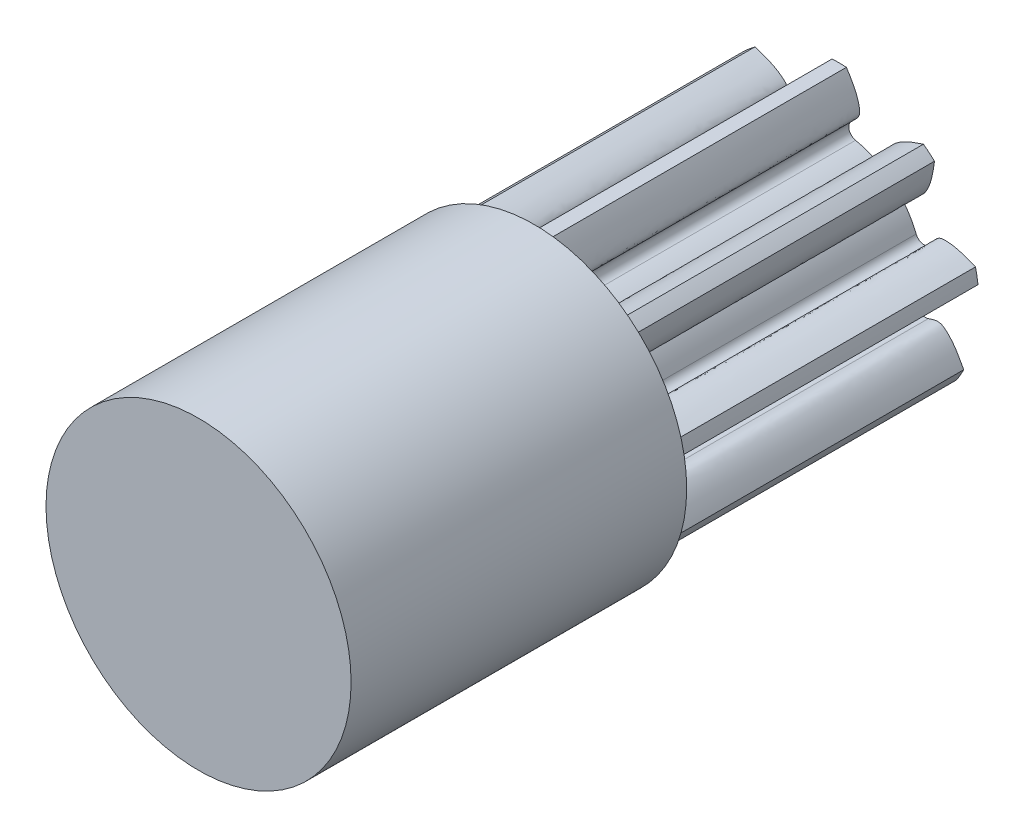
ISO-10303-21;
HEADER;
FILE_DESCRIPTION(('STEP AP214'),'2;1');
FILE_NAME('part.step','',(''),(''),'','','');
FILE_SCHEMA(('AUTOMOTIVE_DESIGN { 1 0 10303 214 1 1 1 1 }'));
ENDSEC;
DATA;
#1=APPLICATION_CONTEXT('core data for automotive mechanical design processes');
#2=APPLICATION_PROTOCOL_DEFINITION('international standard','automotive_design',2000,#1);
#3=PRODUCT_CONTEXT('',#1,'mechanical');
#4=PRODUCT('Part','Part','',(#3));
#5=PRODUCT_RELATED_PRODUCT_CATEGORY('part','',(#4));
#6=PRODUCT_DEFINITION_FORMATION('','',#4);
#7=PRODUCT_DEFINITION_CONTEXT('part definition',#1,'design');
#8=PRODUCT_DEFINITION('design','',#6,#7);
#9=PRODUCT_DEFINITION_SHAPE('','',#8);
#10=(LENGTH_UNIT() NAMED_UNIT(*) SI_UNIT(.MILLI.,.METRE.));
#11=(NAMED_UNIT(*) PLANE_ANGLE_UNIT() SI_UNIT($,.RADIAN.));
#12=(NAMED_UNIT(*) SI_UNIT($,.STERADIAN.) SOLID_ANGLE_UNIT());
#13=UNCERTAINTY_MEASURE_WITH_UNIT(LENGTH_MEASURE(1.E-05),#10,'distance_accuracy_value','');
#14=(GEOMETRIC_REPRESENTATION_CONTEXT(3) GLOBAL_UNCERTAINTY_ASSIGNED_CONTEXT((#13)) GLOBAL_UNIT_ASSIGNED_CONTEXT((#10,
#11,#12)) REPRESENTATION_CONTEXT('',''));
#15=CARTESIAN_POINT('',(0.,0.,0.));
#16=DIRECTION('',(0.,0.,1.));
#17=DIRECTION('',(1.,0.,0.));
#18=AXIS2_PLACEMENT_3D('',#15,#16,#17);
#19=CARTESIAN_POINT('',(0.,0.,0.));
#20=DIRECTION('',(0.,0.,1.));
#21=DIRECTION('',(1.,0.,0.));
#22=AXIS2_PLACEMENT_3D('',#19,#20,#21);
#23=PLANE('',#22);
#24=CARTESIAN_POINT('',(0.,0.,0.));
#25=DIRECTION('',(0.,0.,1.));
#26=DIRECTION('',(1.,0.,0.));
#27=AXIS2_PLACEMENT_3D('',#24,#25,#26);
#28=CIRCLE('',#27,4.0625);
#29=CARTESIAN_POINT('',(3.85016472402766,-1.29620131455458,0.));
#30=VERTEX_POINT('',#29);
#31=CARTESIAN_POINT('',(4.06129182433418,-0.0990705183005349,0.));
#32=VERTEX_POINT('',#31);
#33=EDGE_CURVE('E594',#30,#32,#28,.T.);
#34=ORIENTED_EDGE('',*,*,#33,.F.);
#35=CARTESIAN_POINT('',(4.24499023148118,-1.42912376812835,0.));
#36=DIRECTION('',(0.,0.,1.));
#37=DIRECTION('',(1.,0.,0.));
#38=AXIS2_PLACEMENT_3D('',#35,#36,#37);
#39=CIRCLE('',#38,0.4166);
#40=CARTESIAN_POINT('',(4.37752805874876,-1.82407855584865,0.));
#41=VERTEX_POINT('',#40);
#42=EDGE_CURVE('E579',#30,#41,#39,.T.);
#43=ORIENTED_EDGE('',*,*,#42,.T.);
#44=CARTESIAN_POINT('',(6.12288081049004,-3.12665245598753,0.));
#45=CARTESIAN_POINT('',(5.89284874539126,-2.6954523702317,0.));
#46=CARTESIAN_POINT('',(5.60804962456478,-2.16159025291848,0.));
#47=CARTESIAN_POINT('',(4.79838886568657,-1.53630492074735,0.));
#48=CARTESIAN_POINT('',(4.17908383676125,-2.01415503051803,0.));
#49=CARTESIAN_POINT('',(3.72614272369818,-1.8796594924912,0.));
#50=CARTESIAN_POINT('',(3.61806593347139,-1.84756736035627,0.));
#51=B_SPLINE_CURVE_WITH_KNOTS('',3,(#44,#45,#46,#47,#48,#49,#50),.UNSPECIFIED.,.F.,.F.,(4,1,1,1,
4),(0.,0.456248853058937,0.564874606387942,0.896174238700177,1.),.UNSPECIFIED.);
#52=CARTESIAN_POINT('',(6.12288081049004,-3.12665245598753,0.));
#53=VERTEX_POINT('',#52);
#54=EDGE_CURVE('E392',#53,#41,#51,.T.);
#55=ORIENTED_EDGE('',*,*,#54,.F.);
#56=CARTESIAN_POINT('',(0.,0.,0.));
#57=DIRECTION('',(0.,0.,1.));
#58=DIRECTION('',(0.766044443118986,-0.64278760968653,0.));
#59=AXIS2_PLACEMENT_3D('',#56,#57,#58);
#60=CIRCLE('',#59,6.875);
#61=CARTESIAN_POINT('',(5.76895461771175,-3.73962399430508,0.));
#62=VERTEX_POINT('',#61);
#63=EDGE_CURVE('E1642',#62,#53,#60,.T.);
#64=ORIENTED_EDGE('',*,*,#63,.F.);
#65=CARTESIAN_POINT('',(3.40892772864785,-2.20977781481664,0.));
#66=CARTESIAN_POINT('',(3.49075361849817,-2.28733438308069,0.));
#67=CARTESIAN_POINT('',(3.83367932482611,-2.61236770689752,0.));
#68=CARTESIAN_POINT('',(3.72945045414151,-3.3876197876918,0.));
#69=CARTESIAN_POINT('',(4.67576822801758,-3.7762262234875,0.));
#70=CARTESIAN_POINT('',(5.2805072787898,-3.75597826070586,0.));
#71=CARTESIAN_POINT('',(5.76895461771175,-3.73962399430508,0.));
#72=B_SPLINE_CURVE_WITH_KNOTS('',3,(#65,#66,#67,#68,#69,#70,#71),.UNSPECIFIED.,.F.,.F.,(4,1,1,1,
4),(0.,0.103825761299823,0.435125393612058,0.543751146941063,1.),.UNSPECIFIED.);
#73=CARTESIAN_POINT('',(3.76827280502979,-2.87925937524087,0.));
#74=VERTEX_POINT('',#73);
#75=EDGE_CURVE('E1643',#74,#62,#72,.T.);
#76=ORIENTED_EDGE('',*,*,#75,.F.);
#77=CARTESIAN_POINT('',(3.35995756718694,-2.96192875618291,0.));
#78=DIRECTION('',(0.,0.,1.));
#79=DIRECTION('',(1.,0.,0.));
#80=AXIS2_PLACEMENT_3D('',#77,#78,#79);
#81=CIRCLE('',#80,0.4166);
#82=CARTESIAN_POINT('',(3.04744873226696,-2.68644048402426,0.));
#83=VERTEX_POINT('',#82);
#84=EDGE_CURVE('E43',#74,#83,#81,.T.);
#85=ORIENTED_EDGE('',*,*,#84,.T.);
#86=CARTESIAN_POINT('',(2.11621514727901,-3.46778599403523,0.));
#87=VERTEX_POINT('',#86);
#88=EDGE_CURVE('E599',#87,#83,#28,.T.);
#89=ORIENTED_EDGE('',*,*,#88,.F.);
#90=CARTESIAN_POINT('',(2.33322812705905,-3.82339944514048,0.));
#91=DIRECTION('',(0.,0.,1.));
#92=DIRECTION('',(1.,0.,0.));
#93=AXIS2_PLACEMENT_3D('',#90,#91,#92);
#94=CIRCLE('',#93,0.4166);
#95=CARTESIAN_POINT('',(2.18088594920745,-4.21114603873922,0.));
#96=VERTEX_POINT('',#95);
#97=EDGE_CURVE('E566',#87,#96,#94,.T.);
#98=ORIENTED_EDGE('',*,*,#97,.T.);
#99=CARTESIAN_POINT('',(2.68062536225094,-6.33086666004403,0.));
#100=CARTESIAN_POINT('',(2.78158064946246,-5.85268646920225,0.));
#101=CARTESIAN_POINT('',(2.90657181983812,-5.26065901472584,0.));
#102=CARTESIAN_POINT('',(2.68826135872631,-4.26122275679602,0.));
#103=CARTESIAN_POINT('',(1.90669005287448,-4.22919557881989,0.));
#104=CARTESIAN_POINT('',(1.64616909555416,-3.83502108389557,0.));
#105=CARTESIAN_POINT('',(1.58400589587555,-3.74096666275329,0.));
#106=B_SPLINE_CURVE_WITH_KNOTS('',3,(#99,#100,#101,#102,#103,#104,#105),.UNSPECIFIED.,.F.,.F.,
(4,1,1,1,4),(0.,0.456248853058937,0.564874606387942,0.896174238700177,1.),.UNSPECIFIED.);
#107=CARTESIAN_POINT('',(2.68062536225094,-6.33086666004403,0.));
#108=VERTEX_POINT('',#107);
#109=EDGE_CURVE('E1511',#108,#96,#106,.T.);
#110=ORIENTED_EDGE('',*,*,#109,.F.);
#111=CARTESIAN_POINT('',(0.,0.,0.));
#112=DIRECTION('',(0.,0.,1.));
#113=DIRECTION('',(0.17364817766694,-0.984807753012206,0.));
#114=AXIS2_PLACEMENT_3D('',#111,#112,#113);
#115=CIRCLE('',#114,6.875);
#116=CARTESIAN_POINT('',(2.01549165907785,-6.57293072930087,0.));
#117=VERTEX_POINT('',#116);
#118=EDGE_CURVE('E1556',#117,#108,#115,.T.);
#119=ORIENTED_EDGE('',*,*,#118,.F.);
#120=CARTESIAN_POINT('',(1.19097234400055,-3.8840045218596,0.));
#121=CARTESIAN_POINT('',(1.20380221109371,-3.99601296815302,0.));
#122=CARTESIAN_POINT('',(1.25757114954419,-4.465431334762,0.));
#123=CARTESIAN_POINT('',(0.679404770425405,-4.99231185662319,0.));
#124=CARTESIAN_POINT('',(1.15453484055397,-5.89828299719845,0.));
#125=CARTESIAN_POINT('',(1.6308069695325,-6.27149092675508,0.));
#126=CARTESIAN_POINT('',(2.01549165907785,-6.57293072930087,0.));
#127=B_SPLINE_CURVE_WITH_KNOTS('',3,(#120,#121,#122,#123,#124,#125,#126),.UNSPECIFIED.,.F.,.F.,
(4,1,1,1,4),(0.,0.103825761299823,0.435125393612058,0.543751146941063,1.),.UNSPECIFIED.);
#128=CARTESIAN_POINT('',(1.03591219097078,-4.62783971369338,0.));
#129=VERTEX_POINT('',#128);
#130=EDGE_CURVE('E1553',#129,#117,#127,.T.);
#131=ORIENTED_EDGE('',*,*,#130,.F.);
#132=CARTESIAN_POINT('',(0.669985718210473,-4.42870815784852,0.));
#133=DIRECTION('',(0.,0.,1.));
#134=DIRECTION('',(1.,0.,0.));
#135=AXIS2_PLACEMENT_3D('',#132,#133,#134);
#136=CIRCLE('',#135,0.4166);
#137=CARTESIAN_POINT('',(0.60767050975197,-4.0167950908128,0.));
#138=VERTEX_POINT('',#137);
#139=EDGE_CURVE('E569',#129,#138,#136,.T.);
#140=ORIENTED_EDGE('',*,*,#139,.T.);
#141=CARTESIAN_POINT('',(-0.607935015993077,-4.01675506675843,0.));
#142=VERTEX_POINT('',#141);
#143=EDGE_CURVE('E601',#142,#138,#28,.T.);
#144=ORIENTED_EDGE('',*,*,#143,.F.);
#145=CARTESIAN_POINT('',(-0.670277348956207,-4.42866402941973,0.));
#146=DIRECTION('',(0.,0.,1.));
#147=DIRECTION('',(1.,0.,0.));
#148=AXIS2_PLACEMENT_3D('',#145,#146,#147);
#149=CIRCLE('',#148,0.4166);
#150=CARTESIAN_POINT('',(-1.03621693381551,-4.62777148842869,0.));
#151=VERTEX_POINT('',#150);
#152=EDGE_CURVE('E547',#142,#151,#149,.T.);
#153=ORIENTED_EDGE('',*,*,#152,.T.);
#154=CARTESIAN_POINT('',(-2.01592448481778,-6.57279799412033,0.));
#155=CARTESIAN_POINT('',(-1.63121994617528,-6.27138352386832,0.));
#156=CARTESIAN_POINT('',(-1.15492324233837,-5.89820695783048,0.));
#157=CARTESIAN_POINT('',(-0.679733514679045,-4.9922671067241,0.));
#158=CARTESIAN_POINT('',(-1.2578651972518,-4.46534851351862,0.));
#159=CARTESIAN_POINT('',(-1.20406534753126,-3.99593368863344,0.));
#160=CARTESIAN_POINT('',(-1.19122810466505,-3.88392608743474,0.));
#161=B_SPLINE_CURVE_WITH_KNOTS('',3,(#154,#155,#156,#157,#158,#159,#160),.UNSPECIFIED.,.F.,.F.,
(4,1,1,1,4),(0.,0.456248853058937,0.564874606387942,0.896174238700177,1.),.UNSPECIFIED.);
#162=CARTESIAN_POINT('',(-2.01592448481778,-6.57279799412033,0.));
#163=VERTEX_POINT('',#162);
#164=EDGE_CURVE('E652',#163,#151,#161,.T.);
#165=ORIENTED_EDGE('',*,*,#164,.F.);
#166=CARTESIAN_POINT('',(0.,0.,0.));
#167=DIRECTION('',(0.,0.,1.));
#168=DIRECTION('',(-0.499999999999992,-0.866025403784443,0.));
#169=AXIS2_PLACEMENT_3D('',#166,#167,#168);
#170=CIRCLE('',#169,6.875);
#171=CARTESIAN_POINT('',(-2.68104224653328,-6.33069012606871,0.));
#172=VERTEX_POINT('',#171);
#173=EDGE_CURVE('E659',#172,#163,#170,.T.);
#174=ORIENTED_EDGE('',*,*,#173,.F.);
#175=CARTESIAN_POINT('',(-1.58425223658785,-3.74086234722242,0.));
#176=CARTESIAN_POINT('',(-1.64642162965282,-3.83491267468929,0.));
#177=CARTESIAN_POINT('',(-1.90696854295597,-4.22907001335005,0.));
#178=CARTESIAN_POINT('',(-2.68854195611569,-4.26104572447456,0.));
#179=CARTESIAN_POINT('',(-2.90691823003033,-5.26046760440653,0.));
#180=CARTESIAN_POINT('',(-2.78196604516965,-5.85250328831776,0.));
#181=CARTESIAN_POINT('',(-2.68104224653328,-6.33069012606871,0.));
#182=B_SPLINE_CURVE_WITH_KNOTS('',3,(#175,#176,#177,#178,#179,#180,#181),.UNSPECIFIED.,.F.,.F.,
(4,1,1,1,4),(0.,0.103825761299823,0.435125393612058,0.543751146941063,1.),.UNSPECIFIED.);
#183=CARTESIAN_POINT('',(-2.18116325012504,-4.21100241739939,0.));
#184=VERTEX_POINT('',#183);
#185=EDGE_CURVE('E664',#184,#172,#182,.T.);
#186=ORIENTED_EDGE('',*,*,#185,.F.);
#187=CARTESIAN_POINT('',(-2.33347989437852,-3.82324579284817,0.));
#188=DIRECTION('',(0.,0.,1.));
#189=DIRECTION('',(1.,0.,0.));
#190=AXIS2_PLACEMENT_3D('',#187,#188,#189);
#191=CIRCLE('',#190,0.4166);
#192=CARTESIAN_POINT('',(-2.11644349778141,-3.4676466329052,0.));
#193=VERTEX_POINT('',#192);
#194=EDGE_CURVE('E552',#184,#193,#191,.T.);
#195=ORIENTED_EDGE('',*,*,#194,.T.);
#196=CARTESIAN_POINT('',(-3.04762562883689,-2.68623980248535,0.));
#197=VERTEX_POINT('',#196);
#198=EDGE_CURVE('E625',#197,#193,#28,.T.);
#199=ORIENTED_EDGE('',*,*,#198,.F.);
#200=CARTESIAN_POINT('',(-3.3601526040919,-2.96170749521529,0.));
#201=DIRECTION('',(0.,0.,1.));
#202=DIRECTION('',(1.,0.,0.));
#203=AXIS2_PLACEMENT_3D('',#200,#201,#202);
#204=CIRCLE('',#203,0.4166);
#205=CARTESIAN_POINT('',(-3.76846239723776,-2.87901122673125,0.));
#206=VERTEX_POINT('',#205);
#207=EDGE_CURVE('E527',#197,#206,#204,.T.);
#208=ORIENTED_EDGE('',*,*,#207,.T.);
#209=CARTESIAN_POINT('',(-5.76920086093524,-3.73924409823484,0.));
#210=CARTESIAN_POINT('',(-5.28075460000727,-3.75563052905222,0.));
#211=CARTESIAN_POINT('',(-4.67601688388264,-3.77591831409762,0.));
#212=CARTESIAN_POINT('',(-3.72967352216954,-3.38737419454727,0.));
#213=CARTESIAN_POINT('',(-3.83385134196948,-2.61211525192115,0.));
#214=CARTESIAN_POINT('',(-3.49090423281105,-2.28710451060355,0.));
#215=CARTESIAN_POINT('',(-3.40907323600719,-2.20955333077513,0.));
#216=B_SPLINE_CURVE_WITH_KNOTS('',3,(#209,#210,#211,#212,#213,#214,#215),.UNSPECIFIED.,.F.,.F.,
(4,1,1,1,4),(0.,0.456248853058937,0.564874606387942,0.896174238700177,1.),.UNSPECIFIED.);
#217=CARTESIAN_POINT('',(-5.76920086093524,-3.73924409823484,0.));
#218=VERTEX_POINT('',#217);
#219=EDGE_CURVE('E1473',#218,#206,#216,.T.);
#220=ORIENTED_EDGE('',*,*,#219,.F.);
#221=CARTESIAN_POINT('',(0.,0.,0.));
#222=DIRECTION('',(0.,0.,1.));
#223=DIRECTION('',(-0.939692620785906,-0.342020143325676,0.));
#224=AXIS2_PLACEMENT_3D('',#221,#222,#223);
#225=CIRCLE('',#224,6.875);
#226=CARTESIAN_POINT('',(-6.12308668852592,-3.12624925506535,0.));
#227=VERTEX_POINT('',#226);
#228=EDGE_CURVE('E1481',#227,#218,#225,.T.);
#229=ORIENTED_EDGE('',*,*,#228,.F.);
#230=CARTESIAN_POINT('',(-3.61818758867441,-1.84732910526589,0.));
#231=CARTESIAN_POINT('',(-3.72626649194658,-1.87941412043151,0.));
#232=CARTESIAN_POINT('',(-4.17921646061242,-2.01387983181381,0.));
#233=CARTESIAN_POINT('',(-4.79849002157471,-1.53598894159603,0.));
#234=CARTESIAN_POINT('',(-5.60819195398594,-2.1612209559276,0.));
#235=CARTESIAN_POINT('',(-5.89302622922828,-2.69506431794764,0.));
#236=CARTESIAN_POINT('',(-6.12308668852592,-3.12624925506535,0.));
#237=B_SPLINE_CURVE_WITH_KNOTS('',3,(#230,#231,#232,#233,#234,#235,#236),.UNSPECIFIED.,.F.,.F.,
(4,1,1,1,4),(0.,0.103825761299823,0.435125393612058,0.543751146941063,1.),.UNSPECIFIED.);
#238=CARTESIAN_POINT('',(-4.37764816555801,-1.82379028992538,0.));
#239=VERTEX_POINT('',#238);
#240=EDGE_CURVE('E1486',#239,#227,#237,.T.);
#241=ORIENTED_EDGE('',*,*,#240,.F.);
#242=CARTESIAN_POINT('',(-4.24508433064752,-1.42884423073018,0.));
#243=DIRECTION('',(0.,0.,1.));
#244=DIRECTION('',(1.,0.,0.));
#245=AXIS2_PLACEMENT_3D('',#242,#243,#244);
#246=CIRCLE('',#245,0.4166);
#247=CARTESIAN_POINT('',(-3.85025007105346,-1.29594777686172,0.));
#248=VERTEX_POINT('',#247);
#249=EDGE_CURVE('E532',#239,#248,#246,.T.);
#250=ORIENTED_EDGE('',*,*,#249,.T.);
#251=CARTESIAN_POINT('',(-4.06129833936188,-0.0988030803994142,0.));
#252=VERTEX_POINT('',#251);
#253=EDGE_CURVE('E620',#252,#248,#28,.T.);
#254=ORIENTED_EDGE('',*,*,#253,.F.);
#255=CARTESIAN_POINT('',(-4.47777511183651,-0.108935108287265,0.));
#256=DIRECTION('',(0.,0.,1.));
#257=DIRECTION('',(1.,0.,0.));
#258=AXIS2_PLACEMENT_3D('',#255,#256,#257);
#259=CIRCLE('',#258,0.4166);
#260=CARTESIAN_POINT('',(-4.7374024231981,0.216870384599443,0.));
#261=VERTEX_POINT('',#260);
#262=EDGE_CURVE('E507',#252,#261,#259,.T.);
#263=ORIENTED_EDGE('',*,*,#262,.T.);
#264=CARTESIAN_POINT('',(-6.82300403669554,0.843943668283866,0.));
#265=CARTESIAN_POINT('',(-6.45936548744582,0.517423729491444,0.));
#266=CARTESIAN_POINT('',(-6.00915025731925,0.113164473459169,0.));
#267=CARTESIAN_POINT('',(-5.03445783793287,-0.197491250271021,0.));
#268=CARTESIAN_POINT('',(-4.6159358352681,0.463355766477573,0.));
#269=CARTESIAN_POINT('',(-4.14431023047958,0.491886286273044,0.));
#270=CARTESIAN_POINT('',(-4.03177511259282,0.498693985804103,0.));
#271=B_SPLINE_CURVE_WITH_KNOTS('',3,(#264,#265,#266,#267,#268,#269,#270),.UNSPECIFIED.,.F.,.F.,
(4,1,1,1,4),(0.,0.456248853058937,0.564874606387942,0.896174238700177,1.),.UNSPECIFIED.);
#272=CARTESIAN_POINT('',(-6.82300403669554,0.843943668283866,0.));
#273=VERTEX_POINT('',#272);
#274=EDGE_CURVE('E722',#273,#261,#271,.T.);
#275=ORIENTED_EDGE('',*,*,#274,.F.);
#276=CARTESIAN_POINT('',(0.,0.,0.));
#277=DIRECTION('',(0.,0.,1.));
#278=DIRECTION('',(-0.939692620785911,0.342020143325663,0.));
#279=AXIS2_PLACEMENT_3D('',#276,#277,#278);
#280=CIRCLE('',#279,6.875);
#281=CARTESIAN_POINT('',(-6.70007081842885,1.5409983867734,0.));
#282=VERTEX_POINT('',#281);
#283=EDGE_CURVE('E717',#282,#273,#280,.T.);
#284=ORIENTED_EDGE('',*,*,#283,.F.);
#285=CARTESIAN_POINT('',(-3.95913275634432,0.910589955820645,0.));
#286=CARTESIAN_POINT('',(-4.06254984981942,0.955483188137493,0.));
#287=CARTESIAN_POINT('',(-4.49596254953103,1.14362710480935,0.));
#288=CARTESIAN_POINT('',(-4.66317127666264,1.90777413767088,0.));
#289=CARTESIAN_POINT('',(-5.68533033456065,1.94928499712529,0.));
#290=CARTESIAN_POINT('',(-6.24667394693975,1.7234251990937,0.));
#291=CARTESIAN_POINT('',(-6.70007081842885,1.5409983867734,0.));
#292=B_SPLINE_CURVE_WITH_KNOTS('',3,(#285,#286,#287,#288,#289,#290,#291),.UNSPECIFIED.,.F.,.F.,
(4,1,1,1,4),(0.,0.103825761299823,0.435125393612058,0.543751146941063,1.),.UNSPECIFIED.);
#293=CARTESIAN_POINT('',(-4.52578285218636,1.41679358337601,0.));
#294=VERTEX_POINT('',#293);
#295=EDGE_CURVE('E713',#294,#282,#292,.T.);
#296=ORIENTED_EDGE('',*,*,#295,.F.);
#297=CARTESIAN_POINT('',(-4.17036662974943,1.63412942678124,0.));
#298=DIRECTION('',(0.,0.,1.));
#299=DIRECTION('',(1.,0.,0.));
#300=AXIS2_PLACEMENT_3D('',#297,#298,#299);
#301=CIRCLE('',#300,0.4166);
#302=CARTESIAN_POINT('',(-3.78248184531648,1.48213944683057,0.));
#303=VERTEX_POINT('',#302);
#304=EDGE_CURVE('E512',#294,#303,#301,.T.);
#305=ORIENTED_EDGE('',*,*,#304,.T.);
#306=CARTESIAN_POINT('',(-3.17464442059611,2.53486470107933,0.));
#307=VERTEX_POINT('',#306);
#308=EDGE_CURVE('E615',#307,#303,#28,.T.);
#309=ORIENTED_EDGE('',*,*,#308,.F.);
#310=CARTESIAN_POINT('',(-3.50019687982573,2.79480922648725,0.));
#311=DIRECTION('',(0.,0.,1.));
#312=DIRECTION('',(1.,0.,0.));
#313=AXIS2_PLACEMENT_3D('',#310,#311,#312);
#314=CIRCLE('',#313,0.4166);
#315=CARTESIAN_POINT('',(-3.48965920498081,3.21127593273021,0.));
#316=VERTEX_POINT('',#315);
#317=EDGE_CURVE('E487',#307,#316,#314,.T.);
#318=ORIENTED_EDGE('',*,*,#317,.T.);
#319=CARTESIAN_POINT('',(-4.68424779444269,5.03224081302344,0.));
#320=CARTESIAN_POINT('',(-4.61556747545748,4.54836967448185,0.));
#321=CARTESIAN_POINT('',(-4.53053544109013,3.94929634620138,0.));
#322=CARTESIAN_POINT('',(-3.98356337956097,3.0848000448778,0.));
#323=CARTESIAN_POINT('',(-3.23817265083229,3.32201747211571,0.));
#324=CARTESIAN_POINT('',(-2.85854741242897,3.04071802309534,0.));
#325=CARTESIAN_POINT('',(-2.76796460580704,2.97359684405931,0.));
#326=B_SPLINE_CURVE_WITH_KNOTS('',3,(#319,#320,#321,#322,#323,#324,#325),.UNSPECIFIED.,.F.,.F.,
(4,1,1,1,4),(0.,0.456248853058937,0.564874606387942,0.896174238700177,1.),.UNSPECIFIED.);
#327=CARTESIAN_POINT('',(-4.68424779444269,5.03224081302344,0.));
#328=VERTEX_POINT('',#327);
#329=EDGE_CURVE('E1434',#328,#316,#326,.T.);
#330=ORIENTED_EDGE('',*,*,#329,.F.);
#331=CARTESIAN_POINT('',(0.,0.,0.));
#332=DIRECTION('',(0.,0.,1.));
#333=DIRECTION('',(-0.500000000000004,0.866025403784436,0.));
#334=AXIS2_PLACEMENT_3D('',#331,#332,#333);
#335=CIRCLE('',#334,6.875);
#336=CARTESIAN_POINT('',(-4.14201734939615,5.48719575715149,0.));
#337=VERTEX_POINT('',#336);
#338=EDGE_CURVE('E1442',#337,#328,#335,.T.);
#339=ORIENTED_EDGE('',*,*,#338,.F.);
#340=CARTESIAN_POINT('',(-2.44755570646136,3.24243385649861,0.));
#341=CARTESIAN_POINT('',(-2.49792098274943,3.34329929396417,0.));
#342=CARTESIAN_POINT('',(-2.70899779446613,3.76601820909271,0.));
#343=CARTESIAN_POINT('',(-2.34590286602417,4.45886849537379,0.));
#344=CARTESIAN_POINT('',(-3.10223946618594,5.14769883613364,0.));
#345=CARTESIAN_POINT('',(-3.6774335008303,5.33550491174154,0.));
#346=CARTESIAN_POINT('',(-4.14201734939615,5.48719575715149,0.));
#347=B_SPLINE_CURVE_WITH_KNOTS('',3,(#340,#341,#342,#343,#344,#345,#346),.UNSPECIFIED.,.F.,.F.,
(4,1,1,1,4),(0.,0.103825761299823,0.435125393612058,0.543751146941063,1.),.UNSPECIFIED.);
#348=CARTESIAN_POINT('',(-2.55625344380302,3.99444399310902,0.));
#349=VERTEX_POINT('',#348);
#350=EDGE_CURVE('E1447',#349,#337,#347,.T.);
#351=ORIENTED_EDGE('',*,*,#350,.F.);
#352=CARTESIAN_POINT('',(-2.14428803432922,3.93247576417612,0.));
#353=DIRECTION('',(0.,0.,1.));
#354=DIRECTION('',(1.,0.,0.));
#355=AXIS2_PLACEMENT_3D('',#352,#353,#354);
#356=CIRCLE('',#355,0.4166);
#357=CARTESIAN_POINT('',(-1.94484832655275,3.56671715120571,0.));
#358=VERTEX_POINT('',#357);
#359=EDGE_CURVE('E492',#349,#358,#356,.T.);
#360=ORIENTED_EDGE('',*,*,#359,.T.);
#361=CARTESIAN_POINT('',(-0.802539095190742,3.98244111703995,0.));
#362=VERTEX_POINT('',#361);
#363=EDGE_CURVE('E610',#362,#358,#28,.T.);
#364=ORIENTED_EDGE('',*,*,#363,.F.);
#365=CARTESIAN_POINT('',(-0.884837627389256,4.39083126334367,0.));
#366=DIRECTION('',(0.,0.,1.));
#367=DIRECTION('',(1.,0.,0.));
#368=AXIS2_PLACEMENT_3D('',#365,#366,#367);
#369=CIRCLE('',#368,0.4166);
#370=CARTESIAN_POINT('',(-0.609065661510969,4.70308978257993,0.));
#371=VERTEX_POINT('',#370);
#372=EDGE_CURVE('E467',#362,#371,#369,.T.);
#373=ORIENTED_EDGE('',*,*,#372,.T.);
#374=CARTESIAN_POINT('',(-0.353679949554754,6.8658965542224,0.));
#375=CARTESIAN_POINT('',(-0.612094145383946,6.45108289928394,0.));
#376=CARTESIAN_POINT('',(-0.932032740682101,5.93750856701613,0.));
#377=CARTESIAN_POINT('',(-1.068715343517,4.92367911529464,0.));
#378=CARTESIAN_POINT('',(-0.345232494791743,4.6262702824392,0.));
#379=CARTESIAN_POINT('',(-0.235238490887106,4.16676400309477,0.));
#380=CARTESIAN_POINT('',(-0.208992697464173,4.05712069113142,0.));
#381=B_SPLINE_CURVE_WITH_KNOTS('',3,(#374,#375,#376,#377,#378,#379,#380),.UNSPECIFIED.,.F.,.F.,
(4,1,1,1,4),(0.,0.456248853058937,0.564874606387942,0.896174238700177,1.),.UNSPECIFIED.);
#382=CARTESIAN_POINT('',(-0.353679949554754,6.8658965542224,0.));
#383=VERTEX_POINT('',#382);
#384=EDGE_CURVE('E783',#383,#371,#381,.T.);
#385=ORIENTED_EDGE('',*,*,#384,.F.);
#386=CARTESIAN_POINT('',(0.,0.,0.));
#387=DIRECTION('',(0.,0.,1.));
#388=DIRECTION('',(0.173648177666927,0.984807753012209,0.));
#389=AXIS2_PLACEMENT_3D('',#386,#387,#388);
#390=CIRCLE('',#389,6.875);
#391=CARTESIAN_POINT('',(0.354132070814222,6.86587324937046,0.));
#392=VERTEX_POINT('',#391);
#393=EDGE_CURVE('E778',#392,#383,#390,.T.);
#394=ORIENTED_EDGE('',*,*,#393,.F.);
#395=CARTESIAN_POINT('',(0.209259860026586,4.05710692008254,0.));
#396=CARTESIAN_POINT('',(0.235512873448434,4.16674850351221,0.));
#397=CARTESIAN_POINT('',(0.345537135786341,4.62624753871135,0.));
#398=CARTESIAN_POINT('',(1.06903956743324,4.92360872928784,0.));
#399=CARTESIAN_POINT('',(0.932423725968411,5.93744717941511,0.));
#400=CARTESIAN_POINT('',(0.612518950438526,6.45104257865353,0.));
#401=CARTESIAN_POINT('',(0.354132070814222,6.86587324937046,0.));
#402=B_SPLINE_CURVE_WITH_KNOTS('',3,(#395,#396,#397,#398,#399,#400,#401),.UNSPECIFIED.,.F.,.F.,
(4,1,1,1,4),(0.,0.103825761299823,0.435125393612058,0.543751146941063,1.),.UNSPECIFIED.);
#403=CARTESIAN_POINT('',(0.609375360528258,4.70304966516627,0.));
#404=VERTEX_POINT('',#403);
#405=EDGE_CURVE('E774',#404,#392,#402,.T.);
#406=ORIENTED_EDGE('',*,*,#405,.F.);
#407=CARTESIAN_POINT('',(0.885126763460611,4.39077298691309,0.));
#408=DIRECTION('',(0.,0.,1.));
#409=DIRECTION('',(1.,0.,0.));
#410=AXIS2_PLACEMENT_3D('',#407,#408,#409);
#411=CIRCLE('',#410,0.4166);
#412=CARTESIAN_POINT('',(0.802801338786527,3.98238826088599,0.));
#413=VERTEX_POINT('',#412);
#414=EDGE_CURVE('E472',#404,#413,#411,.T.);
#415=ORIENTED_EDGE('',*,*,#414,.T.);
#416=CARTESIAN_POINT('',(1.94508319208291,3.56658907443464,0.));
#417=VERTEX_POINT('',#416);
#418=EDGE_CURVE('E605',#417,#413,#28,.T.);
#419=ORIENTED_EDGE('',*,*,#418,.F.);
#420=CARTESIAN_POINT('',(2.14454698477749,3.93233455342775,0.));
#421=DIRECTION('',(0.,0.,1.));
#422=DIRECTION('',(1.,0.,0.));
#423=AXIS2_PLACEMENT_3D('',#420,#421,#422);
#424=CIRCLE('',#423,0.4166);
#425=CARTESIAN_POINT('',(2.55651647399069,3.99427565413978,0.));
#426=VERTEX_POINT('',#425);
#427=EDGE_CURVE('E447',#417,#426,#424,.T.);
#428=ORIENTED_EDGE('',*,*,#427,.T.);
#429=CARTESIAN_POINT('',(4.14237867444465,5.48692299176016,0.));
#430=CARTESIAN_POINT('',(3.67778483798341,5.3352627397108,0.));
#431=CARTESIAN_POINT('',(3.10257843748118,5.14749454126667,0.));
#432=CARTESIAN_POINT('',(2.3461964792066,4.45871400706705,0.));
#433=CARTESIAN_POINT('',(2.70924578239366,3.76583981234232,0.));
#434=CARTESIAN_POINT('',(2.49814113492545,3.34313479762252,0.));
#435=CARTESIAN_POINT('',(2.44776921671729,3.24227267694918,0.));
#436=B_SPLINE_CURVE_WITH_KNOTS('',3,(#429,#430,#431,#432,#433,#434,#435),.UNSPECIFIED.,.F.,.F.,
(4,1,1,1,4),(0.,0.456248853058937,0.564874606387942,0.896174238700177,1.),.UNSPECIFIED.);
#437=CARTESIAN_POINT('',(4.14237867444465,5.48692299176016,0.));
#438=VERTEX_POINT('',#437);
#439=EDGE_CURVE('E1395',#438,#426,#436,.T.);
#440=ORIENTED_EDGE('',*,*,#439,.F.);
#441=CARTESIAN_POINT('',(0.,0.,0.));
#442=DIRECTION('',(0.,0.,1.));
#443=DIRECTION('',(0.766044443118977,0.642787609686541,0.));
#444=AXIS2_PLACEMENT_3D('',#441,#442,#443);
#445=CIRCLE('',#444,6.875);
#446=CARTESIAN_POINT('',(4.68457915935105,5.03193234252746,0.));
#447=VERTEX_POINT('',#446);
#448=EDGE_CURVE('E1403',#447,#438,#445,.T.);
#449=ORIENTED_EDGE('',*,*,#448,.F.);
#450=CARTESIAN_POINT('',(2.7681604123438,2.97341456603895,0.));
#451=CARTESIAN_POINT('',(2.85874763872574,3.04052978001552,0.));
#452=CARTESIAN_POINT('',(3.23839139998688,3.32180422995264,0.));
#453=CARTESIAN_POINT('',(3.98376650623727,3.0845377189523,0.));
#454=CARTESIAN_POINT('',(4.53079549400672,3.94899800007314,0.));
#455=CARTESIAN_POINT('',(4.6158669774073,4.54806572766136,0.));
#456=CARTESIAN_POINT('',(4.68457915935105,5.03193234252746,0.));
#457=B_SPLINE_CURVE_WITH_KNOTS('',3,(#450,#451,#452,#453,#454,#455,#456),.UNSPECIFIED.,.F.,.F.,
(4,1,1,1,4),(0.,0.103825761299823,0.435125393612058,0.543751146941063,1.),.UNSPECIFIED.);
#458=CARTESIAN_POINT('',(3.48987066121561,3.21104613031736,0.));
#459=VERTEX_POINT('',#458);
#460=EDGE_CURVE('E1408',#459,#447,#457,.T.);
#461=ORIENTED_EDGE('',*,*,#460,.F.);
#462=CARTESIAN_POINT('',(3.50038091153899,2.79457873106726,0.));
#463=DIRECTION('',(0.,0.,1.));
#464=DIRECTION('',(1.,0.,0.));
#465=AXIS2_PLACEMENT_3D('',#462,#463,#464);
#466=CIRCLE('',#465,0.4166);
#467=CARTESIAN_POINT('',(3.17481133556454,2.53465564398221,0.));
#468=VERTEX_POINT('',#467);
#469=EDGE_CURVE('E452',#459,#468,#466,.T.);
#470=ORIENTED_EDGE('',*,*,#469,.T.);
#471=CARTESIAN_POINT('',(3.78257943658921,1.48189036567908,0.));
#472=VERTEX_POINT('',#471);
#473=EDGE_CURVE('E409',#472,#468,#28,.T.);
#474=ORIENTED_EDGE('',*,*,#473,.F.);
#475=CARTESIAN_POINT('',(4.17047422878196,1.63385480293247,0.));
#476=DIRECTION('',(0.,0.,1.));
#477=DIRECTION('',(1.,0.,0.));
#478=AXIS2_PLACEMENT_3D('',#475,#476,#477);
#479=CIRCLE('',#478,0.4166);
#480=CARTESIAN_POINT('',(4.52587613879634,1.41649555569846,0.));
#481=VERTEX_POINT('',#480);
#482=EDGE_CURVE('E426',#472,#481,#479,.T.);
#483=ORIENTED_EDGE('',*,*,#482,.T.);
#484=CARTESIAN_POINT('',(6.70017227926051,1.54055718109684,0.));
#485=CARTESIAN_POINT('',(6.24678742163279,1.72301384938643,0.));
#486=CARTESIAN_POINT('',(5.68545868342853,1.94891061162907,0.));
#487=CARTESIAN_POINT('',(4.66329689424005,1.90746706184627,0.));
#488=CARTESIAN_POINT('',(4.49603784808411,1.14333104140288,0.));
#489=CARTESIAN_POINT('',(4.06261275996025,0.955215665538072,0.));
#490=CARTESIAN_POINT('',(3.95919271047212,0.910329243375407,0.));
#491=B_SPLINE_CURVE_WITH_KNOTS('',3,(#484,#485,#486,#487,#488,#489,#490),.UNSPECIFIED.,.F.,.F.,
(4,1,1,1,4),(0.,0.456248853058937,0.564874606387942,0.896174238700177,1.),.UNSPECIFIED.);
#492=CARTESIAN_POINT('',(6.70017227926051,1.54055718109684,0.));
#493=VERTEX_POINT('',#492);
#494=EDGE_CURVE('E844',#493,#481,#491,.T.);
#495=ORIENTED_EDGE('',*,*,#494,.F.);
#496=CARTESIAN_POINT('',(0.,0.,0.));
#497=DIRECTION('',(0.,0.,1.));
#498=DIRECTION('',(1.,0.,0.));
#499=AXIS2_PLACEMENT_3D('',#496,#497,#498);
#500=CIRCLE('',#499,6.875);
#501=CARTESIAN_POINT('',(6.82305959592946,0.843494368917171,0.));
#502=VERTEX_POINT('',#501);
#503=EDGE_CURVE('E839',#502,#493,#500,.T.);
#504=ORIENTED_EDGE('',*,*,#503,.F.);
#505=CARTESIAN_POINT('',(4.03180794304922,0.498428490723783,0.));
#506=CARTESIAN_POINT('',(4.14434261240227,0.491613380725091,0.));
#507=CARTESIAN_POINT('',(4.61596633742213,0.463051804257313,0.));
#508=CARTESIAN_POINT('',(5.03444482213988,-0.197822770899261,0.));
#509=CARTESIAN_POINT('',(6.00915769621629,0.112768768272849,0.));
#510=CARTESIAN_POINT('',(6.45939954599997,0.516998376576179,0.));
#511=CARTESIAN_POINT('',(6.82305959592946,0.84349436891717,0.));
#512=B_SPLINE_CURVE_WITH_KNOTS('',3,(#505,#506,#507,#508,#509,#510,#511),.UNSPECIFIED.,.F.,.F.,
(4,1,1,1,4),(0.,0.103825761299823,0.435125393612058,0.543751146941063,1.),.UNSPECIFIED.);
#513=CARTESIAN_POINT('',(4.73741669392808,0.216558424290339,0.));
#514=VERTEX_POINT('',#513);
#515=EDGE_CURVE('E835',#514,#502,#512,.T.);
#516=ORIENTED_EDGE('',*,*,#515,.F.);
#517=CARTESIAN_POINT('',(4.47776792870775,-0.109229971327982,0.));
#518=DIRECTION('',(0.,0.,1.));
#519=DIRECTION('',(1.,0.,0.));
#520=AXIS2_PLACEMENT_3D('',#517,#518,#519);
#521=CIRCLE('',#520,0.4166);
#522=EDGE_CURVE('E431',#514,#32,#521,.T.);
#523=ORIENTED_EDGE('',*,*,#522,.T.);
#524=EDGE_LOOP('',(#34,#43,#55,#64,#76,#85,#89,#98,#110,#119,#131,#140,#144,#153,#165,#174,#186,
#195,#199,#208,#220,#229,#241,#250,#254,#263,#275,#284,#296,#305,#309,#318,#330,#339,#351,#360,
#364,#373,#385,#394,#406,#415,#419,#428,#440,#449,#461,#470,#474,#483,#495,#504,#516,#523));
#525=FACE_BOUND('',#524,.T.);
#526=ADVANCED_FACE('F35',(#525),#23,.F.);
#527=CARTESIAN_POINT('',(0.,0.,15.));
#528=DIRECTION('',(0.,0.,-1.));
#529=DIRECTION('',(-1.,0.,0.));
#530=AXIS2_PLACEMENT_3D('',#527,#528,#529);
#531=CYLINDRICAL_SURFACE('',#530,4.0625);
#532=ORIENTED_EDGE('',*,*,#88,.T.);
#533=DIRECTION('',(0.,0.,-1.));
#534=VECTOR('',#533,1.);
#535=CARTESIAN_POINT('',(3.04744873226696,-2.68644048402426,15.));
#536=LINE('',#535,#534);
#537=CARTESIAN_POINT('',(3.04744873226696,-2.68644048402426,15.));
#538=VERTEX_POINT('',#537);
#539=EDGE_CURVE('E56',#83,#538,#536,.F.);
#540=ORIENTED_EDGE('',*,*,#539,.T.);
#541=CARTESIAN_POINT('',(0.,0.,15.));
#542=DIRECTION('',(0.,0.,1.));
#543=DIRECTION('',(1.,0.,0.));
#544=AXIS2_PLACEMENT_3D('',#541,#542,#543);
#545=CIRCLE('',#544,4.0625);
#546=CARTESIAN_POINT('',(2.11621514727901,-3.46778599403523,15.));
#547=VERTEX_POINT('',#546);
#548=EDGE_CURVE('E397',#547,#538,#545,.T.);
#549=ORIENTED_EDGE('',*,*,#548,.F.);
#550=DIRECTION('',(0.,0.,-1.));
#551=VECTOR('',#550,1.);
#552=CARTESIAN_POINT('',(2.11621514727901,-3.46778599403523,15.));
#553=LINE('',#552,#551);
#554=EDGE_CURVE('E557',#547,#87,#553,.T.);
#555=ORIENTED_EDGE('',*,*,#554,.T.);
#556=EDGE_LOOP('',(#532,#540,#549,#555));
#557=FACE_BOUND('',#556,.T.);
#558=ADVANCED_FACE('F871',(#557),#531,.T.);
#559=CARTESIAN_POINT('',(3.85016472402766,-1.29620131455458,15.));
#560=VERTEX_POINT('',#559);
#561=CARTESIAN_POINT('',(4.06129182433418,-0.0990705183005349,15.));
#562=VERTEX_POINT('',#561);
#563=EDGE_CURVE('E404',#560,#562,#545,.T.);
#564=ORIENTED_EDGE('',*,*,#563,.F.);
#565=DIRECTION('',(0.,0.,-1.));
#566=VECTOR('',#565,1.);
#567=CARTESIAN_POINT('',(3.85016472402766,-1.29620131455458,15.));
#568=LINE('',#567,#566);
#569=EDGE_CURVE('E574',#560,#30,#568,.T.);
#570=ORIENTED_EDGE('',*,*,#569,.T.);
#571=ORIENTED_EDGE('',*,*,#33,.T.);
#572=DIRECTION('',(0.,0.,-1.));
#573=VECTOR('',#572,1.);
#574=CARTESIAN_POINT('',(4.06129182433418,-0.0990705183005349,15.));
#575=LINE('',#574,#573);
#576=EDGE_CURVE('E414',#32,#562,#575,.F.);
#577=ORIENTED_EDGE('',*,*,#576,.T.);
#578=EDGE_LOOP('',(#564,#570,#571,#577));
#579=FACE_BOUND('',#578,.T.);
#580=ADVANCED_FACE('F593',(#579),#531,.T.);
#581=ORIENTED_EDGE('',*,*,#143,.T.);
#582=DIRECTION('',(0.,0.,-1.));
#583=VECTOR('',#582,1.);
#584=CARTESIAN_POINT('',(0.60767050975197,-4.0167950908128,15.));
#585=LINE('',#584,#583);
#586=CARTESIAN_POINT('',(0.60767050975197,-4.0167950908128,15.));
#587=VERTEX_POINT('',#586);
#588=EDGE_CURVE('E564',#138,#587,#585,.F.);
#589=ORIENTED_EDGE('',*,*,#588,.T.);
#590=CARTESIAN_POINT('',(-0.607935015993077,-4.01675506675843,15.));
#591=VERTEX_POINT('',#590);
#592=EDGE_CURVE('E403',#591,#587,#545,.T.);
#593=ORIENTED_EDGE('',*,*,#592,.F.);
#594=DIRECTION('',(0.,0.,-1.));
#595=VECTOR('',#594,1.);
#596=CARTESIAN_POINT('',(-0.607935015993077,-4.01675506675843,15.));
#597=LINE('',#596,#595);
#598=EDGE_CURVE('E537',#591,#142,#597,.T.);
#599=ORIENTED_EDGE('',*,*,#598,.T.);
#600=EDGE_LOOP('',(#581,#589,#593,#599));
#601=FACE_BOUND('',#600,.T.);
#602=ADVANCED_FACE('F637',(#601),#531,.T.);
#603=ORIENTED_EDGE('',*,*,#198,.T.);
#604=DIRECTION('',(0.,0.,-1.));
#605=VECTOR('',#604,1.);
#606=CARTESIAN_POINT('',(-2.11644349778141,-3.4676466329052,15.));
#607=LINE('',#606,#605);
#608=CARTESIAN_POINT('',(-2.11644349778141,-3.4676466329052,15.));
#609=VERTEX_POINT('',#608);
#610=EDGE_CURVE('E545',#193,#609,#607,.F.);
#611=ORIENTED_EDGE('',*,*,#610,.T.);
#612=CARTESIAN_POINT('',(-3.04762562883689,-2.68623980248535,15.));
#613=VERTEX_POINT('',#612);
#614=EDGE_CURVE('E407',#613,#609,#545,.T.);
#615=ORIENTED_EDGE('',*,*,#614,.F.);
#616=DIRECTION('',(0.,0.,-1.));
#617=VECTOR('',#616,1.);
#618=CARTESIAN_POINT('',(-3.04762562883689,-2.68623980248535,15.));
#619=LINE('',#618,#617);
#620=EDGE_CURVE('E517',#613,#197,#619,.T.);
#621=ORIENTED_EDGE('',*,*,#620,.T.);
#622=EDGE_LOOP('',(#603,#611,#615,#621));
#623=FACE_BOUND('',#622,.T.);
#624=ADVANCED_FACE('F895',(#623),#531,.T.);
#625=ORIENTED_EDGE('',*,*,#253,.T.);
#626=DIRECTION('',(0.,0.,-1.));
#627=VECTOR('',#626,1.);
#628=CARTESIAN_POINT('',(-3.85025007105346,-1.29594777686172,15.));
#629=LINE('',#628,#627);
#630=CARTESIAN_POINT('',(-3.85025007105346,-1.29594777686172,15.));
#631=VERTEX_POINT('',#630);
#632=EDGE_CURVE('E525',#248,#631,#629,.F.);
#633=ORIENTED_EDGE('',*,*,#632,.T.);
#634=CARTESIAN_POINT('',(-4.06129833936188,-0.0988030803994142,15.));
#635=VERTEX_POINT('',#634);
#636=EDGE_CURVE('E1593',#635,#631,#545,.T.);
#637=ORIENTED_EDGE('',*,*,#636,.F.);
#638=DIRECTION('',(0.,0.,-1.));
#639=VECTOR('',#638,1.);
#640=CARTESIAN_POINT('',(-4.06129833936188,-0.0988030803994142,15.));
#641=LINE('',#640,#639);
#642=EDGE_CURVE('E497',#635,#252,#641,.T.);
#643=ORIENTED_EDGE('',*,*,#642,.T.);
#644=EDGE_LOOP('',(#625,#633,#637,#643));
#645=FACE_BOUND('',#644,.T.);
#646=ADVANCED_FACE('F891',(#645),#531,.T.);
#647=ORIENTED_EDGE('',*,*,#308,.T.);
#648=DIRECTION('',(0.,0.,-1.));
#649=VECTOR('',#648,1.);
#650=CARTESIAN_POINT('',(-3.78248184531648,1.48213944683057,15.));
#651=LINE('',#650,#649);
#652=CARTESIAN_POINT('',(-3.78248184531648,1.48213944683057,15.));
#653=VERTEX_POINT('',#652);
#654=EDGE_CURVE('E505',#303,#653,#651,.F.);
#655=ORIENTED_EDGE('',*,*,#654,.T.);
#656=CARTESIAN_POINT('',(-3.17464442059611,2.53486470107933,15.));
#657=VERTEX_POINT('',#656);
#658=EDGE_CURVE('E1595',#657,#653,#545,.T.);
#659=ORIENTED_EDGE('',*,*,#658,.F.);
#660=DIRECTION('',(0.,0.,-1.));
#661=VECTOR('',#660,1.);
#662=CARTESIAN_POINT('',(-3.17464442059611,2.53486470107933,15.));
#663=LINE('',#662,#661);
#664=EDGE_CURVE('E477',#657,#307,#663,.T.);
#665=ORIENTED_EDGE('',*,*,#664,.T.);
#666=EDGE_LOOP('',(#647,#655,#659,#665));
#667=FACE_BOUND('',#666,.T.);
#668=ADVANCED_FACE('F887',(#667),#531,.T.);
#669=ORIENTED_EDGE('',*,*,#363,.T.);
#670=DIRECTION('',(0.,0.,-1.));
#671=VECTOR('',#670,1.);
#672=CARTESIAN_POINT('',(-1.94484832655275,3.56671715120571,15.));
#673=LINE('',#672,#671);
#674=CARTESIAN_POINT('',(-1.94484832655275,3.56671715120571,15.));
#675=VERTEX_POINT('',#674);
#676=EDGE_CURVE('E485',#358,#675,#673,.F.);
#677=ORIENTED_EDGE('',*,*,#676,.T.);
#678=CARTESIAN_POINT('',(-0.802539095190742,3.98244111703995,15.));
#679=VERTEX_POINT('',#678);
#680=EDGE_CURVE('E1619',#679,#675,#545,.T.);
#681=ORIENTED_EDGE('',*,*,#680,.F.);
#682=DIRECTION('',(0.,0.,-1.));
#683=VECTOR('',#682,1.);
#684=CARTESIAN_POINT('',(-0.802539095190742,3.98244111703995,15.));
#685=LINE('',#684,#683);
#686=EDGE_CURVE('E457',#679,#362,#685,.T.);
#687=ORIENTED_EDGE('',*,*,#686,.T.);
#688=EDGE_LOOP('',(#669,#677,#681,#687));
#689=FACE_BOUND('',#688,.T.);
#690=ADVANCED_FACE('F883',(#689),#531,.T.);
#691=ORIENTED_EDGE('',*,*,#418,.T.);
#692=DIRECTION('',(0.,0.,-1.));
#693=VECTOR('',#692,1.);
#694=CARTESIAN_POINT('',(0.802801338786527,3.98238826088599,15.));
#695=LINE('',#694,#693);
#696=CARTESIAN_POINT('',(0.802801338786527,3.98238826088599,15.));
#697=VERTEX_POINT('',#696);
#698=EDGE_CURVE('E465',#413,#697,#695,.F.);
#699=ORIENTED_EDGE('',*,*,#698,.T.);
#700=CARTESIAN_POINT('',(1.94508319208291,3.56658907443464,15.));
#701=VERTEX_POINT('',#700);
#702=EDGE_CURVE('E415',#701,#697,#545,.T.);
#703=ORIENTED_EDGE('',*,*,#702,.F.);
#704=DIRECTION('',(0.,0.,-1.));
#705=VECTOR('',#704,1.);
#706=CARTESIAN_POINT('',(1.94508319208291,3.56658907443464,15.));
#707=LINE('',#706,#705);
#708=EDGE_CURVE('E437',#701,#417,#707,.T.);
#709=ORIENTED_EDGE('',*,*,#708,.T.);
#710=EDGE_LOOP('',(#691,#699,#703,#709));
#711=FACE_BOUND('',#710,.T.);
#712=ADVANCED_FACE('F879',(#711),#531,.T.);
#713=ORIENTED_EDGE('',*,*,#473,.T.);
#714=DIRECTION('',(0.,0.,-1.));
#715=VECTOR('',#714,1.);
#716=CARTESIAN_POINT('',(3.17481133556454,2.53465564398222,15.));
#717=LINE('',#716,#715);
#718=CARTESIAN_POINT('',(3.17481133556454,2.53465564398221,15.));
#719=VERTEX_POINT('',#718);
#720=EDGE_CURVE('E445',#468,#719,#717,.F.);
#721=ORIENTED_EDGE('',*,*,#720,.T.);
#722=CARTESIAN_POINT('',(3.78257943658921,1.48189036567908,15.));
#723=VERTEX_POINT('',#722);
#724=EDGE_CURVE('E410',#723,#719,#545,.T.);
#725=ORIENTED_EDGE('',*,*,#724,.F.);
#726=DIRECTION('',(0.,0.,-1.));
#727=VECTOR('',#726,1.);
#728=CARTESIAN_POINT('',(3.78257943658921,1.48189036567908,15.));
#729=LINE('',#728,#727);
#730=EDGE_CURVE('E418',#723,#472,#729,.T.);
#731=ORIENTED_EDGE('',*,*,#730,.T.);
#732=EDGE_LOOP('',(#713,#721,#725,#731));
#733=FACE_BOUND('',#732,.T.);
#734=ADVANCED_FACE('F37',(#733),#531,.T.);
#735=CARTESIAN_POINT('',(4.03180794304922,0.498428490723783,15.));
#736=CARTESIAN_POINT('',(4.14434261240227,0.491613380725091,15.));
#737=CARTESIAN_POINT('',(4.61596633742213,0.463051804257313,15.));
#738=CARTESIAN_POINT('',(5.03444482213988,-0.197822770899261,15.));
#739=CARTESIAN_POINT('',(6.00915769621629,0.112768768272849,15.));
#740=CARTESIAN_POINT('',(6.45939954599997,0.516998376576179,15.));
#741=CARTESIAN_POINT('',(6.82305959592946,0.84349436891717,15.));
#742=B_SPLINE_CURVE_WITH_KNOTS('',3,(#735,#736,#737,#738,#739,#740,#741),.UNSPECIFIED.,.F.,.F.,
(4,1,1,1,4),(0.,0.103825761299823,0.435125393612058,0.543751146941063,1.),.UNSPECIFIED.);
#743=DIRECTION('',(0.,0.,-1.));
#744=VECTOR('',#743,1.);
#745=SURFACE_OF_LINEAR_EXTRUSION('',#742,#744);
#746=CARTESIAN_POINT('',(4.73741669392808,0.216558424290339,15.));
#747=VERTEX_POINT('',#746);
#748=CARTESIAN_POINT('',(6.82305959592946,0.843494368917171,15.));
#749=VERTEX_POINT('',#748);
#750=EDGE_CURVE('E849',#747,#749,#742,.T.);
#751=ORIENTED_EDGE('',*,*,#750,.F.);
#752=DIRECTION('',(0.,0.,-1.));
#753=VECTOR('',#752,1.);
#754=CARTESIAN_POINT('',(4.73741669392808,0.216558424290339,15.));
#755=LINE('',#754,#753);
#756=EDGE_CURVE('E423',#747,#514,#755,.T.);
#757=ORIENTED_EDGE('',*,*,#756,.T.);
#758=ORIENTED_EDGE('',*,*,#515,.T.);
#759=DIRECTION('',(0.,0.,-1.));
#760=VECTOR('',#759,1.);
#761=CARTESIAN_POINT('',(6.82305959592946,0.843494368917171,15.));
#762=LINE('',#761,#760);
#763=EDGE_CURVE('E600',#749,#502,#762,.T.);
#764=ORIENTED_EDGE('',*,*,#763,.F.);
#765=EDGE_LOOP('',(#751,#757,#758,#764));
#766=FACE_BOUND('',#765,.T.);
#767=ADVANCED_FACE('F864',(#766),#745,.F.);
#768=CARTESIAN_POINT('',(0.,0.,15.));
#769=DIRECTION('',(0.,0.,-1.));
#770=DIRECTION('',(-1.,0.,0.));
#771=AXIS2_PLACEMENT_3D('',#768,#769,#770);
#772=CYLINDRICAL_SURFACE('',#771,6.875);
#773=ORIENTED_EDGE('',*,*,#503,.T.);
#774=DIRECTION('',(0.,0.,-1.));
#775=VECTOR('',#774,1.);
#776=CARTESIAN_POINT('',(6.70017227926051,1.54055718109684,15.));
#777=LINE('',#776,#775);
#778=CARTESIAN_POINT('',(6.70017227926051,1.54055718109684,15.));
#779=VERTEX_POINT('',#778);
#780=EDGE_CURVE('E603',#779,#493,#777,.T.);
#781=ORIENTED_EDGE('',*,*,#780,.F.);
#782=CARTESIAN_POINT('',(0.,0.,15.));
#783=DIRECTION('',(0.,0.,1.));
#784=DIRECTION('',(1.,0.,0.));
#785=AXIS2_PLACEMENT_3D('',#782,#783,#784);
#786=CIRCLE('',#785,6.875);
#787=EDGE_CURVE('E858',#749,#779,#786,.T.);
#788=ORIENTED_EDGE('',*,*,#787,.F.);
#789=ORIENTED_EDGE('',*,*,#763,.T.);
#790=EDGE_LOOP('',(#773,#781,#788,#789));
#791=FACE_BOUND('',#790,.T.);
#792=ADVANCED_FACE('F867',(#791),#772,.T.);
#793=CARTESIAN_POINT('',(6.70017227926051,1.54055718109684,15.));
#794=CARTESIAN_POINT('',(6.24678742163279,1.72301384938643,15.));
#795=CARTESIAN_POINT('',(5.68545868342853,1.94891061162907,15.));
#796=CARTESIAN_POINT('',(4.66329689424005,1.90746706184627,15.));
#797=CARTESIAN_POINT('',(4.49603784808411,1.14333104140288,15.));
#798=CARTESIAN_POINT('',(4.06261275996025,0.955215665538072,15.));
#799=CARTESIAN_POINT('',(3.95919271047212,0.910329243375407,15.));
#800=B_SPLINE_CURVE_WITH_KNOTS('',3,(#793,#794,#795,#796,#797,#798,#799),.UNSPECIFIED.,.F.,.F.,
(4,1,1,1,4),(0.,0.456248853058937,0.564874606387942,0.896174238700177,1.),.UNSPECIFIED.);
#801=DIRECTION('',(0.,0.,-1.));
#802=VECTOR('',#801,1.);
#803=SURFACE_OF_LINEAR_EXTRUSION('',#800,#802);
#804=ORIENTED_EDGE('',*,*,#494,.T.);
#805=DIRECTION('',(0.,0.,-1.));
#806=VECTOR('',#805,1.);
#807=CARTESIAN_POINT('',(4.52587613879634,1.41649555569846,0.));
#808=LINE('',#807,#806);
#809=CARTESIAN_POINT('',(4.52587613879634,1.41649555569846,15.));
#810=VERTEX_POINT('',#809);
#811=EDGE_CURVE('E421',#481,#810,#808,.F.);
#812=ORIENTED_EDGE('',*,*,#811,.T.);
#813=EDGE_CURVE('E1377',#779,#810,#800,.T.);
#814=ORIENTED_EDGE('',*,*,#813,.F.);
#815=ORIENTED_EDGE('',*,*,#780,.T.);
#816=EDGE_LOOP('',(#804,#812,#814,#815));
#817=FACE_BOUND('',#816,.T.);
#818=ADVANCED_FACE('F1318',(#817),#803,.F.);
#819=CARTESIAN_POINT('',(4.17047422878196,1.63385480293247,7.5));
#820=DIRECTION('',(0.,0.,-1.));
#821=DIRECTION('',(-1.,0.,0.));
#822=AXIS2_PLACEMENT_3D('',#819,#820,#821);
#823=CYLINDRICAL_SURFACE('',#822,0.4166);
#824=CARTESIAN_POINT('',(4.17047422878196,1.63385480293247,15.));
#825=DIRECTION('',(0.,0.,1.));
#826=DIRECTION('',(1.,0.,0.));
#827=AXIS2_PLACEMENT_3D('',#824,#825,#826);
#828=CIRCLE('',#827,0.4166);
#829=EDGE_CURVE('E428',#810,#723,#828,.F.);
#830=ORIENTED_EDGE('',*,*,#829,.F.);
#831=ORIENTED_EDGE('',*,*,#811,.F.);
#832=ORIENTED_EDGE('',*,*,#482,.F.);
#833=ORIENTED_EDGE('',*,*,#730,.F.);
#834=EDGE_LOOP('',(#830,#831,#832,#833));
#835=FACE_BOUND('',#834,.T.);
#836=ADVANCED_FACE('F1307',(#835),#823,.F.);
#837=CARTESIAN_POINT('',(4.47776792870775,-0.109229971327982,7.5));
#838=DIRECTION('',(0.,0.,-1.));
#839=DIRECTION('',(-1.,0.,0.));
#840=AXIS2_PLACEMENT_3D('',#837,#838,#839);
#841=CYLINDRICAL_SURFACE('',#840,0.4166);
#842=CARTESIAN_POINT('',(4.47776792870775,-0.109229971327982,15.));
#843=DIRECTION('',(0.,0.,1.));
#844=DIRECTION('',(1.,0.,0.));
#845=AXIS2_PLACEMENT_3D('',#842,#843,#844);
#846=CIRCLE('',#845,0.4166);
#847=EDGE_CURVE('E434',#562,#747,#846,.F.);
#848=ORIENTED_EDGE('',*,*,#847,.F.);
#849=ORIENTED_EDGE('',*,*,#576,.F.);
#850=ORIENTED_EDGE('',*,*,#522,.F.);
#851=ORIENTED_EDGE('',*,*,#756,.F.);
#852=EDGE_LOOP('',(#848,#849,#850,#851));
#853=FACE_BOUND('',#852,.T.);
#854=ADVANCED_FACE('F1298',(#853),#841,.F.);
#855=CARTESIAN_POINT('',(2.7681604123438,2.97341456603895,15.));
#856=CARTESIAN_POINT('',(2.85874763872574,3.04052978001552,15.));
#857=CARTESIAN_POINT('',(3.23839139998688,3.32180422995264,15.));
#858=CARTESIAN_POINT('',(3.98376650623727,3.0845377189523,15.));
#859=CARTESIAN_POINT('',(4.53079549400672,3.94899800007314,15.));
#860=CARTESIAN_POINT('',(4.6158669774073,4.54806572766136,15.));
#861=CARTESIAN_POINT('',(4.68457915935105,5.03193234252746,15.));
#862=B_SPLINE_CURVE_WITH_KNOTS('',3,(#855,#856,#857,#858,#859,#860,#861),.UNSPECIFIED.,.F.,.F.,
(4,1,1,1,4),(0.,0.103825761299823,0.435125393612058,0.543751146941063,1.),.UNSPECIFIED.);
#863=DIRECTION('',(0.,0.,-1.));
#864=VECTOR('',#863,1.);
#865=SURFACE_OF_LINEAR_EXTRUSION('',#862,#864);
#866=CARTESIAN_POINT('',(3.48987066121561,3.21104613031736,15.));
#867=VERTEX_POINT('',#866);
#868=CARTESIAN_POINT('',(4.68457915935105,5.03193234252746,15.));
#869=VERTEX_POINT('',#868);
#870=EDGE_CURVE('E1390',#867,#869,#862,.T.);
#871=ORIENTED_EDGE('',*,*,#870,.F.);
#872=DIRECTION('',(0.,0.,-1.));
#873=VECTOR('',#872,1.);
#874=CARTESIAN_POINT('',(3.48987066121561,3.21104613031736,15.));
#875=LINE('',#874,#873);
#876=EDGE_CURVE('E442',#867,#459,#875,.T.);
#877=ORIENTED_EDGE('',*,*,#876,.T.);
#878=ORIENTED_EDGE('',*,*,#460,.T.);
#879=DIRECTION('',(0.,0.,-1.));
#880=VECTOR('',#879,1.);
#881=CARTESIAN_POINT('',(4.68457915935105,5.03193234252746,15.));
#882=LINE('',#881,#880);
#883=EDGE_CURVE('E832',#869,#447,#882,.T.);
#884=ORIENTED_EDGE('',*,*,#883,.F.);
#885=EDGE_LOOP('',(#871,#877,#878,#884));
#886=FACE_BOUND('',#885,.T.);
#887=ADVANCED_FACE('F1290',(#886),#865,.F.);
#888=CARTESIAN_POINT('',(0.,0.,15.));
#889=DIRECTION('',(0.,0.,-1.));
#890=DIRECTION('',(-1.,0.,0.));
#891=AXIS2_PLACEMENT_3D('',#888,#889,#890);
#892=CYLINDRICAL_SURFACE('',#891,6.875);
#893=ORIENTED_EDGE('',*,*,#448,.T.);
#894=DIRECTION('',(0.,0.,-1.));
#895=VECTOR('',#894,1.);
#896=CARTESIAN_POINT('',(4.14237867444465,5.48692299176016,15.));
#897=LINE('',#896,#895);
#898=CARTESIAN_POINT('',(4.14237867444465,5.48692299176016,15.));
#899=VERTEX_POINT('',#898);
#900=EDGE_CURVE('E824',#899,#438,#897,.T.);
#901=ORIENTED_EDGE('',*,*,#900,.F.);
#902=CARTESIAN_POINT('',(0.,0.,15.));
#903=DIRECTION('',(0.,0.,1.));
#904=DIRECTION('',(0.766044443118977,0.642787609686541,0.));
#905=AXIS2_PLACEMENT_3D('',#902,#903,#904);
#906=CIRCLE('',#905,6.875);
#907=EDGE_CURVE('E825',#869,#899,#906,.T.);
#908=ORIENTED_EDGE('',*,*,#907,.F.);
#909=ORIENTED_EDGE('',*,*,#883,.T.);
#910=EDGE_LOOP('',(#893,#901,#908,#909));
#911=FACE_BOUND('',#910,.T.);
#912=ADVANCED_FACE('F814',(#911),#892,.T.);
#913=CARTESIAN_POINT('',(4.14237867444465,5.48692299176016,15.));
#914=CARTESIAN_POINT('',(3.67778483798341,5.3352627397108,15.));
#915=CARTESIAN_POINT('',(3.10257843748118,5.14749454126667,15.));
#916=CARTESIAN_POINT('',(2.3461964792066,4.45871400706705,15.));
#917=CARTESIAN_POINT('',(2.70924578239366,3.76583981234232,15.));
#918=CARTESIAN_POINT('',(2.49814113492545,3.34313479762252,15.));
#919=CARTESIAN_POINT('',(2.44776921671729,3.24227267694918,15.));
#920=B_SPLINE_CURVE_WITH_KNOTS('',3,(#913,#914,#915,#916,#917,#918,#919),.UNSPECIFIED.,.F.,.F.,
(4,1,1,1,4),(0.,0.456248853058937,0.564874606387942,0.896174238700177,1.),.UNSPECIFIED.);
#921=DIRECTION('',(0.,0.,-1.));
#922=VECTOR('',#921,1.);
#923=SURFACE_OF_LINEAR_EXTRUSION('',#920,#922);
#924=ORIENTED_EDGE('',*,*,#439,.T.);
#925=DIRECTION('',(0.,0.,-1.));
#926=VECTOR('',#925,1.);
#927=CARTESIAN_POINT('',(2.55651647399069,3.99427565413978,0.));
#928=LINE('',#927,#926);
#929=CARTESIAN_POINT('',(2.55651647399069,3.99427565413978,15.));
#930=VERTEX_POINT('',#929);
#931=EDGE_CURVE('E440',#426,#930,#928,.F.);
#932=ORIENTED_EDGE('',*,*,#931,.T.);
#933=EDGE_CURVE('E817',#899,#930,#920,.T.);
#934=ORIENTED_EDGE('',*,*,#933,.F.);
#935=ORIENTED_EDGE('',*,*,#900,.T.);
#936=EDGE_LOOP('',(#924,#932,#934,#935));
#937=FACE_BOUND('',#936,.T.);
#938=ADVANCED_FACE('F808',(#937),#923,.F.);
#939=CARTESIAN_POINT('',(0.209259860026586,4.05710692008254,15.));
#940=CARTESIAN_POINT('',(0.235512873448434,4.16674850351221,15.));
#941=CARTESIAN_POINT('',(0.345537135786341,4.62624753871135,15.));
#942=CARTESIAN_POINT('',(1.06903956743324,4.92360872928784,15.));
#943=CARTESIAN_POINT('',(0.932423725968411,5.93744717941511,15.));
#944=CARTESIAN_POINT('',(0.612518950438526,6.45104257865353,15.));
#945=CARTESIAN_POINT('',(0.354132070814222,6.86587324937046,15.));
#946=B_SPLINE_CURVE_WITH_KNOTS('',3,(#939,#940,#941,#942,#943,#944,#945),.UNSPECIFIED.,.F.,.F.,
(4,1,1,1,4),(0.,0.103825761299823,0.435125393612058,0.543751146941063,1.),.UNSPECIFIED.);
#947=DIRECTION('',(0.,0.,-1.));
#948=VECTOR('',#947,1.);
#949=SURFACE_OF_LINEAR_EXTRUSION('',#946,#948);
#950=CARTESIAN_POINT('',(0.609375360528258,4.70304966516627,15.));
#951=VERTEX_POINT('',#950);
#952=CARTESIAN_POINT('',(0.354132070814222,6.86587324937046,15.));
#953=VERTEX_POINT('',#952);
#954=EDGE_CURVE('E788',#951,#953,#946,.T.);
#955=ORIENTED_EDGE('',*,*,#954,.F.);
#956=DIRECTION('',(0.,0.,-1.));
#957=VECTOR('',#956,1.);
#958=CARTESIAN_POINT('',(0.609375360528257,4.70304966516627,15.));
#959=LINE('',#958,#957);
#960=EDGE_CURVE('E462',#951,#404,#959,.T.);
#961=ORIENTED_EDGE('',*,*,#960,.T.);
#962=ORIENTED_EDGE('',*,*,#405,.T.);
#963=DIRECTION('',(0.,0.,-1.));
#964=VECTOR('',#963,1.);
#965=CARTESIAN_POINT('',(0.354132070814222,6.86587324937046,15.));
#966=LINE('',#965,#964);
#967=EDGE_CURVE('E1412',#953,#392,#966,.T.);
#968=ORIENTED_EDGE('',*,*,#967,.F.);
#969=EDGE_LOOP('',(#955,#961,#962,#968));
#970=FACE_BOUND('',#969,.T.);
#971=ADVANCED_FACE('F803',(#970),#949,.F.);
#972=CARTESIAN_POINT('',(0.,0.,15.));
#973=DIRECTION('',(0.,0.,-1.));
#974=DIRECTION('',(-1.,0.,0.));
#975=AXIS2_PLACEMENT_3D('',#972,#973,#974);
#976=CYLINDRICAL_SURFACE('',#975,6.875);
#977=ORIENTED_EDGE('',*,*,#393,.T.);
#978=DIRECTION('',(0.,0.,-1.));
#979=VECTOR('',#978,1.);
#980=CARTESIAN_POINT('',(-0.353679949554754,6.8658965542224,15.));
#981=LINE('',#980,#979);
#982=CARTESIAN_POINT('',(-0.353679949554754,6.8658965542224,15.));
#983=VERTEX_POINT('',#982);
#984=EDGE_CURVE('E1418',#983,#383,#981,.T.);
#985=ORIENTED_EDGE('',*,*,#984,.F.);
#986=CARTESIAN_POINT('',(0.,0.,15.));
#987=DIRECTION('',(0.,0.,1.));
#988=DIRECTION('',(0.173648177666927,0.984807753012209,0.));
#989=AXIS2_PLACEMENT_3D('',#986,#987,#988);
#990=CIRCLE('',#989,6.875);
#991=EDGE_CURVE('E797',#953,#983,#990,.T.);
#992=ORIENTED_EDGE('',*,*,#991,.F.);
#993=ORIENTED_EDGE('',*,*,#967,.T.);
#994=EDGE_LOOP('',(#977,#985,#992,#993));
#995=FACE_BOUND('',#994,.T.);
#996=ADVANCED_FACE('F807',(#995),#976,.T.);
#997=CARTESIAN_POINT('',(-0.353679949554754,6.8658965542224,15.));
#998=CARTESIAN_POINT('',(-0.612094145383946,6.45108289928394,15.));
#999=CARTESIAN_POINT('',(-0.932032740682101,5.93750856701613,15.));
#1000=CARTESIAN_POINT('',(-1.068715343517,4.92367911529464,15.));
#1001=CARTESIAN_POINT('',(-0.345232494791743,4.6262702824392,15.));
#1002=CARTESIAN_POINT('',(-0.235238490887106,4.16676400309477,15.));
#1003=CARTESIAN_POINT('',(-0.208992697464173,4.05712069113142,15.));
#1004=B_SPLINE_CURVE_WITH_KNOTS('',3,(#997,#998,#999,#1000,#1001,#1002,#1003),.UNSPECIFIED.,.F.,
.F.,(4,1,1,1,4),(0.,0.456248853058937,0.564874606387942,0.896174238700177,1.),.UNSPECIFIED.);
#1005=DIRECTION('',(0.,0.,-1.));
#1006=VECTOR('',#1005,1.);
#1007=SURFACE_OF_LINEAR_EXTRUSION('',#1004,#1006);
#1008=ORIENTED_EDGE('',*,*,#384,.T.);
#1009=DIRECTION('',(0.,0.,-1.));
#1010=VECTOR('',#1009,1.);
#1011=CARTESIAN_POINT('',(-0.609065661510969,4.70308978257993,0.));
#1012=LINE('',#1011,#1010);
#1013=CARTESIAN_POINT('',(-0.609065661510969,4.70308978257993,15.));
#1014=VERTEX_POINT('',#1013);
#1015=EDGE_CURVE('E460',#371,#1014,#1012,.F.);
#1016=ORIENTED_EDGE('',*,*,#1015,.T.);
#1017=EDGE_CURVE('E1420',#983,#1014,#1004,.T.);
#1018=ORIENTED_EDGE('',*,*,#1017,.F.);
#1019=ORIENTED_EDGE('',*,*,#984,.T.);
#1020=EDGE_LOOP('',(#1008,#1016,#1018,#1019));
#1021=FACE_BOUND('',#1020,.T.);
#1022=ADVANCED_FACE('F1253',(#1021),#1007,.F.);
#1023=CARTESIAN_POINT('',(-2.44755570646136,3.24243385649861,15.));
#1024=CARTESIAN_POINT('',(-2.49792098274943,3.34329929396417,15.));
#1025=CARTESIAN_POINT('',(-2.70899779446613,3.76601820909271,15.));
#1026=CARTESIAN_POINT('',(-2.34590286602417,4.45886849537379,15.));
#1027=CARTESIAN_POINT('',(-3.10223946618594,5.14769883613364,15.));
#1028=CARTESIAN_POINT('',(-3.6774335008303,5.33550491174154,15.));
#1029=CARTESIAN_POINT('',(-4.14201734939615,5.48719575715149,15.));
#1030=B_SPLINE_CURVE_WITH_KNOTS('',3,(#1023,#1024,#1025,#1026,#1027,#1028,#1029),.UNSPECIFIED.,
.F.,.F.,(4,1,1,1,4),(0.,0.103825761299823,0.435125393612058,0.543751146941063,1.),.UNSPECIFIED.);
#1031=DIRECTION('',(0.,0.,-1.));
#1032=VECTOR('',#1031,1.);
#1033=SURFACE_OF_LINEAR_EXTRUSION('',#1030,#1032);
#1034=CARTESIAN_POINT('',(-2.55625344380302,3.99444399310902,15.));
#1035=VERTEX_POINT('',#1034);
#1036=CARTESIAN_POINT('',(-4.14201734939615,5.48719575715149,15.));
#1037=VERTEX_POINT('',#1036);
#1038=EDGE_CURVE('E1428',#1035,#1037,#1030,.T.);
#1039=ORIENTED_EDGE('',*,*,#1038,.F.);
#1040=DIRECTION('',(0.,0.,-1.));
#1041=VECTOR('',#1040,1.);
#1042=CARTESIAN_POINT('',(-2.55625344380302,3.99444399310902,15.));
#1043=LINE('',#1042,#1041);
#1044=EDGE_CURVE('E482',#1035,#349,#1043,.T.);
#1045=ORIENTED_EDGE('',*,*,#1044,.T.);
#1046=ORIENTED_EDGE('',*,*,#350,.T.);
#1047=DIRECTION('',(0.,0.,-1.));
#1048=VECTOR('',#1047,1.);
#1049=CARTESIAN_POINT('',(-4.14201734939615,5.48719575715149,15.));
#1050=LINE('',#1049,#1048);
#1051=EDGE_CURVE('E771',#1037,#337,#1050,.T.);
#1052=ORIENTED_EDGE('',*,*,#1051,.F.);
#1053=EDGE_LOOP('',(#1039,#1045,#1046,#1052));
#1054=FACE_BOUND('',#1053,.T.);
#1055=ADVANCED_FACE('F1244',(#1054),#1033,.F.);
#1056=CARTESIAN_POINT('',(0.,0.,15.));
#1057=DIRECTION('',(0.,0.,-1.));
#1058=DIRECTION('',(-1.,0.,0.));
#1059=AXIS2_PLACEMENT_3D('',#1056,#1057,#1058);
#1060=CYLINDRICAL_SURFACE('',#1059,6.875);
#1061=ORIENTED_EDGE('',*,*,#338,.T.);
#1062=DIRECTION('',(0.,0.,-1.));
#1063=VECTOR('',#1062,1.);
#1064=CARTESIAN_POINT('',(-4.68424779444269,5.03224081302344,15.));
#1065=LINE('',#1064,#1063);
#1066=CARTESIAN_POINT('',(-4.68424779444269,5.03224081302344,15.));
#1067=VERTEX_POINT('',#1066);
#1068=EDGE_CURVE('E763',#1067,#328,#1065,.T.);
#1069=ORIENTED_EDGE('',*,*,#1068,.F.);
#1070=CARTESIAN_POINT('',(0.,0.,15.));
#1071=DIRECTION('',(0.,0.,1.));
#1072=DIRECTION('',(-0.500000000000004,0.866025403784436,0.));
#1073=AXIS2_PLACEMENT_3D('',#1070,#1071,#1072);
#1074=CIRCLE('',#1073,6.875);
#1075=EDGE_CURVE('E764',#1037,#1067,#1074,.T.);
#1076=ORIENTED_EDGE('',*,*,#1075,.F.);
#1077=ORIENTED_EDGE('',*,*,#1051,.T.);
#1078=EDGE_LOOP('',(#1061,#1069,#1076,#1077));
#1079=FACE_BOUND('',#1078,.T.);
#1080=ADVANCED_FACE('F753',(#1079),#1060,.T.);
#1081=CARTESIAN_POINT('',(-4.68424779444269,5.03224081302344,15.));
#1082=CARTESIAN_POINT('',(-4.61556747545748,4.54836967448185,15.));
#1083=CARTESIAN_POINT('',(-4.53053544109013,3.94929634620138,15.));
#1084=CARTESIAN_POINT('',(-3.98356337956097,3.0848000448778,15.));
#1085=CARTESIAN_POINT('',(-3.23817265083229,3.32201747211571,15.));
#1086=CARTESIAN_POINT('',(-2.85854741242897,3.04071802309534,15.));
#1087=CARTESIAN_POINT('',(-2.76796460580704,2.97359684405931,15.));
#1088=B_SPLINE_CURVE_WITH_KNOTS('',3,(#1081,#1082,#1083,#1084,#1085,#1086,#1087),.UNSPECIFIED.,
.F.,.F.,(4,1,1,1,4),(0.,0.456248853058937,0.564874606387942,0.896174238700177,1.),.UNSPECIFIED.);
#1089=DIRECTION('',(0.,0.,-1.));
#1090=VECTOR('',#1089,1.);
#1091=SURFACE_OF_LINEAR_EXTRUSION('',#1088,#1090);
#1092=ORIENTED_EDGE('',*,*,#329,.T.);
#1093=DIRECTION('',(0.,0.,-1.));
#1094=VECTOR('',#1093,1.);
#1095=CARTESIAN_POINT('',(-3.48965920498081,3.21127593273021,0.));
#1096=LINE('',#1095,#1094);
#1097=CARTESIAN_POINT('',(-3.48965920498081,3.21127593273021,15.));
#1098=VERTEX_POINT('',#1097);
#1099=EDGE_CURVE('E480',#316,#1098,#1096,.F.);
#1100=ORIENTED_EDGE('',*,*,#1099,.T.);
#1101=EDGE_CURVE('E756',#1067,#1098,#1088,.T.);
#1102=ORIENTED_EDGE('',*,*,#1101,.F.);
#1103=ORIENTED_EDGE('',*,*,#1068,.T.);
#1104=EDGE_LOOP('',(#1092,#1100,#1102,#1103));
#1105=FACE_BOUND('',#1104,.T.);
#1106=ADVANCED_FACE('F747',(#1105),#1091,.F.);
#1107=CARTESIAN_POINT('',(-3.95913275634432,0.910589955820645,15.));
#1108=CARTESIAN_POINT('',(-4.06254984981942,0.955483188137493,15.));
#1109=CARTESIAN_POINT('',(-4.49596254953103,1.14362710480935,15.));
#1110=CARTESIAN_POINT('',(-4.66317127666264,1.90777413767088,15.));
#1111=CARTESIAN_POINT('',(-5.68533033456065,1.94928499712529,15.));
#1112=CARTESIAN_POINT('',(-6.24667394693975,1.7234251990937,15.));
#1113=CARTESIAN_POINT('',(-6.70007081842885,1.5409983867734,15.));
#1114=B_SPLINE_CURVE_WITH_KNOTS('',3,(#1107,#1108,#1109,#1110,#1111,#1112,#1113),.UNSPECIFIED.,
.F.,.F.,(4,1,1,1,4),(0.,0.103825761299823,0.435125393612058,0.543751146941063,1.),.UNSPECIFIED.);
#1115=DIRECTION('',(0.,0.,-1.));
#1116=VECTOR('',#1115,1.);
#1117=SURFACE_OF_LINEAR_EXTRUSION('',#1114,#1116);
#1118=CARTESIAN_POINT('',(-4.52578285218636,1.41679358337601,15.));
#1119=VERTEX_POINT('',#1118);
#1120=CARTESIAN_POINT('',(-6.70007081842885,1.5409983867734,15.));
#1121=VERTEX_POINT('',#1120);
#1122=EDGE_CURVE('E727',#1119,#1121,#1114,.T.);
#1123=ORIENTED_EDGE('',*,*,#1122,.F.);
#1124=DIRECTION('',(0.,0.,-1.));
#1125=VECTOR('',#1124,1.);
#1126=CARTESIAN_POINT('',(-4.52578285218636,1.41679358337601,15.));
#1127=LINE('',#1126,#1125);
#1128=EDGE_CURVE('E502',#1119,#294,#1127,.T.);
#1129=ORIENTED_EDGE('',*,*,#1128,.T.);
#1130=ORIENTED_EDGE('',*,*,#295,.T.);
#1131=DIRECTION('',(0.,0.,-1.));
#1132=VECTOR('',#1131,1.);
#1133=CARTESIAN_POINT('',(-6.70007081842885,1.5409983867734,15.));
#1134=LINE('',#1133,#1132);
#1135=EDGE_CURVE('E1451',#1121,#282,#1134,.T.);
#1136=ORIENTED_EDGE('',*,*,#1135,.F.);
#1137=EDGE_LOOP('',(#1123,#1129,#1130,#1136));
#1138=FACE_BOUND('',#1137,.T.);
#1139=ADVANCED_FACE('F742',(#1138),#1117,.F.);
#1140=CARTESIAN_POINT('',(0.,0.,15.));
#1141=DIRECTION('',(0.,0.,-1.));
#1142=DIRECTION('',(-1.,0.,0.));
#1143=AXIS2_PLACEMENT_3D('',#1140,#1141,#1142);
#1144=CYLINDRICAL_SURFACE('',#1143,6.875);
#1145=ORIENTED_EDGE('',*,*,#283,.T.);
#1146=DIRECTION('',(0.,0.,-1.));
#1147=VECTOR('',#1146,1.);
#1148=CARTESIAN_POINT('',(-6.82300403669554,0.843943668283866,15.));
#1149=LINE('',#1148,#1147);
#1150=CARTESIAN_POINT('',(-6.82300403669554,0.843943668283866,15.));
#1151=VERTEX_POINT('',#1150);
#1152=EDGE_CURVE('E1457',#1151,#273,#1149,.T.);
#1153=ORIENTED_EDGE('',*,*,#1152,.F.);
#1154=CARTESIAN_POINT('',(0.,0.,15.));
#1155=DIRECTION('',(0.,0.,1.));
#1156=DIRECTION('',(-0.939692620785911,0.342020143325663,0.));
#1157=AXIS2_PLACEMENT_3D('',#1154,#1155,#1156);
#1158=CIRCLE('',#1157,6.875);
#1159=EDGE_CURVE('E736',#1121,#1151,#1158,.T.);
#1160=ORIENTED_EDGE('',*,*,#1159,.F.);
#1161=ORIENTED_EDGE('',*,*,#1135,.T.);
#1162=EDGE_LOOP('',(#1145,#1153,#1160,#1161));
#1163=FACE_BOUND('',#1162,.T.);
#1164=ADVANCED_FACE('F746',(#1163),#1144,.T.);
#1165=CARTESIAN_POINT('',(-6.82300403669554,0.843943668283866,15.));
#1166=CARTESIAN_POINT('',(-6.45936548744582,0.517423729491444,15.));
#1167=CARTESIAN_POINT('',(-6.00915025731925,0.113164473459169,15.));
#1168=CARTESIAN_POINT('',(-5.03445783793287,-0.197491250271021,15.));
#1169=CARTESIAN_POINT('',(-4.6159358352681,0.463355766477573,15.));
#1170=CARTESIAN_POINT('',(-4.14431023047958,0.491886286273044,15.));
#1171=CARTESIAN_POINT('',(-4.03177511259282,0.498693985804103,15.));
#1172=B_SPLINE_CURVE_WITH_KNOTS('',3,(#1165,#1166,#1167,#1168,#1169,#1170,#1171),.UNSPECIFIED.,
.F.,.F.,(4,1,1,1,4),(0.,0.456248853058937,0.564874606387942,0.896174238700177,1.),.UNSPECIFIED.);
#1173=DIRECTION('',(0.,0.,-1.));
#1174=VECTOR('',#1173,1.);
#1175=SURFACE_OF_LINEAR_EXTRUSION('',#1172,#1174);
#1176=ORIENTED_EDGE('',*,*,#274,.T.);
#1177=DIRECTION('',(0.,0.,-1.));
#1178=VECTOR('',#1177,1.);
#1179=CARTESIAN_POINT('',(-4.7374024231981,0.216870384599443,0.));
#1180=LINE('',#1179,#1178);
#1181=CARTESIAN_POINT('',(-4.7374024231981,0.216870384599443,15.));
#1182=VERTEX_POINT('',#1181);
#1183=EDGE_CURVE('E500',#261,#1182,#1180,.F.);
#1184=ORIENTED_EDGE('',*,*,#1183,.T.);
#1185=EDGE_CURVE('E1459',#1151,#1182,#1172,.T.);
#1186=ORIENTED_EDGE('',*,*,#1185,.F.);
#1187=ORIENTED_EDGE('',*,*,#1152,.T.);
#1188=EDGE_LOOP('',(#1176,#1184,#1186,#1187));
#1189=FACE_BOUND('',#1188,.T.);
#1190=ADVANCED_FACE('F1207',(#1189),#1175,.F.);
#1191=CARTESIAN_POINT('',(-3.61818758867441,-1.84732910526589,15.));
#1192=CARTESIAN_POINT('',(-3.72626649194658,-1.87941412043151,15.));
#1193=CARTESIAN_POINT('',(-4.17921646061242,-2.01387983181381,15.));
#1194=CARTESIAN_POINT('',(-4.79849002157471,-1.53598894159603,15.));
#1195=CARTESIAN_POINT('',(-5.60819195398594,-2.1612209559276,15.));
#1196=CARTESIAN_POINT('',(-5.89302622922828,-2.69506431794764,15.));
#1197=CARTESIAN_POINT('',(-6.12308668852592,-3.12624925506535,15.));
#1198=B_SPLINE_CURVE_WITH_KNOTS('',3,(#1191,#1192,#1193,#1194,#1195,#1196,#1197),.UNSPECIFIED.,
.F.,.F.,(4,1,1,1,4),(0.,0.103825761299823,0.435125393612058,0.543751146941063,1.),.UNSPECIFIED.);
#1199=DIRECTION('',(0.,0.,-1.));
#1200=VECTOR('',#1199,1.);
#1201=SURFACE_OF_LINEAR_EXTRUSION('',#1198,#1200);
#1202=CARTESIAN_POINT('',(-4.37764816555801,-1.82379028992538,15.));
#1203=VERTEX_POINT('',#1202);
#1204=CARTESIAN_POINT('',(-6.12308668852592,-3.12624925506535,15.));
#1205=VERTEX_POINT('',#1204);
#1206=EDGE_CURVE('E1467',#1203,#1205,#1198,.T.);
#1207=ORIENTED_EDGE('',*,*,#1206,.F.);
#1208=DIRECTION('',(0.,0.,-1.));
#1209=VECTOR('',#1208,1.);
#1210=CARTESIAN_POINT('',(-4.37764816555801,-1.82379028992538,15.));
#1211=LINE('',#1210,#1209);
#1212=EDGE_CURVE('E522',#1203,#239,#1211,.T.);
#1213=ORIENTED_EDGE('',*,*,#1212,.T.);
#1214=ORIENTED_EDGE('',*,*,#240,.T.);
#1215=DIRECTION('',(0.,0.,-1.));
#1216=VECTOR('',#1215,1.);
#1217=CARTESIAN_POINT('',(-6.12308668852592,-3.12624925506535,15.));
#1218=LINE('',#1217,#1216);
#1219=EDGE_CURVE('E710',#1205,#227,#1218,.T.);
#1220=ORIENTED_EDGE('',*,*,#1219,.F.);
#1221=EDGE_LOOP('',(#1207,#1213,#1214,#1220));
#1222=FACE_BOUND('',#1221,.T.);
#1223=ADVANCED_FACE('F1198',(#1222),#1201,.F.);
#1224=CARTESIAN_POINT('',(0.,0.,15.));
#1225=DIRECTION('',(0.,0.,-1.));
#1226=DIRECTION('',(-1.,0.,0.));
#1227=AXIS2_PLACEMENT_3D('',#1224,#1225,#1226);
#1228=CYLINDRICAL_SURFACE('',#1227,6.875);
#1229=ORIENTED_EDGE('',*,*,#228,.T.);
#1230=DIRECTION('',(0.,0.,-1.));
#1231=VECTOR('',#1230,1.);
#1232=CARTESIAN_POINT('',(-5.76920086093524,-3.73924409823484,15.));
#1233=LINE('',#1232,#1231);
#1234=CARTESIAN_POINT('',(-5.76920086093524,-3.73924409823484,15.));
#1235=VERTEX_POINT('',#1234);
#1236=EDGE_CURVE('E702',#1235,#218,#1233,.T.);
#1237=ORIENTED_EDGE('',*,*,#1236,.F.);
#1238=CARTESIAN_POINT('',(0.,0.,15.));
#1239=DIRECTION('',(0.,0.,1.));
#1240=DIRECTION('',(-0.939692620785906,-0.342020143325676,0.));
#1241=AXIS2_PLACEMENT_3D('',#1238,#1239,#1240);
#1242=CIRCLE('',#1241,6.875);
#1243=EDGE_CURVE('E703',#1205,#1235,#1242,.T.);
#1244=ORIENTED_EDGE('',*,*,#1243,.F.);
#1245=ORIENTED_EDGE('',*,*,#1219,.T.);
#1246=EDGE_LOOP('',(#1229,#1237,#1244,#1245));
#1247=FACE_BOUND('',#1246,.T.);
#1248=ADVANCED_FACE('F692',(#1247),#1228,.T.);
#1249=CARTESIAN_POINT('',(-5.76920086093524,-3.73924409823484,15.));
#1250=CARTESIAN_POINT('',(-5.28075460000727,-3.75563052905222,15.));
#1251=CARTESIAN_POINT('',(-4.67601688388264,-3.77591831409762,15.));
#1252=CARTESIAN_POINT('',(-3.72967352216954,-3.38737419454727,15.));
#1253=CARTESIAN_POINT('',(-3.83385134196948,-2.61211525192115,15.));
#1254=CARTESIAN_POINT('',(-3.49090423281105,-2.28710451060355,15.));
#1255=CARTESIAN_POINT('',(-3.40907323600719,-2.20955333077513,15.));
#1256=B_SPLINE_CURVE_WITH_KNOTS('',3,(#1249,#1250,#1251,#1252,#1253,#1254,#1255),.UNSPECIFIED.,
.F.,.F.,(4,1,1,1,4),(0.,0.456248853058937,0.564874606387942,0.896174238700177,1.),.UNSPECIFIED.);
#1257=DIRECTION('',(0.,0.,-1.));
#1258=VECTOR('',#1257,1.);
#1259=SURFACE_OF_LINEAR_EXTRUSION('',#1256,#1258);
#1260=ORIENTED_EDGE('',*,*,#219,.T.);
#1261=DIRECTION('',(0.,0.,-1.));
#1262=VECTOR('',#1261,1.);
#1263=CARTESIAN_POINT('',(-3.76846239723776,-2.87901122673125,0.));
#1264=LINE('',#1263,#1262);
#1265=CARTESIAN_POINT('',(-3.76846239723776,-2.87901122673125,15.));
#1266=VERTEX_POINT('',#1265);
#1267=EDGE_CURVE('E520',#206,#1266,#1264,.F.);
#1268=ORIENTED_EDGE('',*,*,#1267,.T.);
#1269=EDGE_CURVE('E695',#1235,#1266,#1256,.T.);
#1270=ORIENTED_EDGE('',*,*,#1269,.F.);
#1271=ORIENTED_EDGE('',*,*,#1236,.T.);
#1272=EDGE_LOOP('',(#1260,#1268,#1270,#1271));
#1273=FACE_BOUND('',#1272,.T.);
#1274=ADVANCED_FACE('F686',(#1273),#1259,.F.);
#1275=CARTESIAN_POINT('',(-1.58425223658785,-3.74086234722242,15.));
#1276=CARTESIAN_POINT('',(-1.64642162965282,-3.83491267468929,15.));
#1277=CARTESIAN_POINT('',(-1.90696854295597,-4.22907001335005,15.));
#1278=CARTESIAN_POINT('',(-2.68854195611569,-4.26104572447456,15.));
#1279=CARTESIAN_POINT('',(-2.90691823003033,-5.26046760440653,15.));
#1280=CARTESIAN_POINT('',(-2.78196604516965,-5.85250328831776,15.));
#1281=CARTESIAN_POINT('',(-2.68104224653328,-6.33069012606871,15.));
#1282=B_SPLINE_CURVE_WITH_KNOTS('',3,(#1275,#1276,#1277,#1278,#1279,#1280,#1281),.UNSPECIFIED.,
.F.,.F.,(4,1,1,1,4),(0.,0.103825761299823,0.435125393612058,0.543751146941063,1.),.UNSPECIFIED.);
#1283=DIRECTION('',(0.,0.,-1.));
#1284=VECTOR('',#1283,1.);
#1285=SURFACE_OF_LINEAR_EXTRUSION('',#1282,#1284);
#1286=CARTESIAN_POINT('',(-2.18116325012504,-4.21100241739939,15.));
#1287=VERTEX_POINT('',#1286);
#1288=CARTESIAN_POINT('',(-2.68104224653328,-6.33069012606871,15.));
#1289=VERTEX_POINT('',#1288);
#1290=EDGE_CURVE('E658',#1287,#1289,#1282,.T.);
#1291=ORIENTED_EDGE('',*,*,#1290,.F.);
#1292=DIRECTION('',(0.,0.,-1.));
#1293=VECTOR('',#1292,1.);
#1294=CARTESIAN_POINT('',(-2.18116325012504,-4.21100241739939,15.));
#1295=LINE('',#1294,#1293);
#1296=EDGE_CURVE('E542',#1287,#184,#1295,.T.);
#1297=ORIENTED_EDGE('',*,*,#1296,.T.);
#1298=ORIENTED_EDGE('',*,*,#185,.T.);
#1299=DIRECTION('',(0.,0.,-1.));
#1300=VECTOR('',#1299,1.);
#1301=CARTESIAN_POINT('',(-2.68104224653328,-6.33069012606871,15.));
#1302=LINE('',#1301,#1300);
#1303=EDGE_CURVE('E1490',#1289,#172,#1302,.T.);
#1304=ORIENTED_EDGE('',*,*,#1303,.F.);
#1305=EDGE_LOOP('',(#1291,#1297,#1298,#1304));
#1306=FACE_BOUND('',#1305,.T.);
#1307=ADVANCED_FACE('F681',(#1306),#1285,.F.);
#1308=CARTESIAN_POINT('',(0.,0.,15.));
#1309=DIRECTION('',(0.,0.,-1.));
#1310=DIRECTION('',(-1.,0.,0.));
#1311=AXIS2_PLACEMENT_3D('',#1308,#1309,#1310);
#1312=CYLINDRICAL_SURFACE('',#1311,6.875);
#1313=ORIENTED_EDGE('',*,*,#173,.T.);
#1314=DIRECTION('',(0.,0.,-1.));
#1315=VECTOR('',#1314,1.);
#1316=CARTESIAN_POINT('',(-2.01592448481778,-6.57279799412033,15.));
#1317=LINE('',#1316,#1315);
#1318=CARTESIAN_POINT('',(-2.01592448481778,-6.57279799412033,15.));
#1319=VERTEX_POINT('',#1318);
#1320=EDGE_CURVE('E657',#1319,#163,#1317,.T.);
#1321=ORIENTED_EDGE('',*,*,#1320,.F.);
#1322=CARTESIAN_POINT('',(0.,0.,15.));
#1323=DIRECTION('',(0.,0.,1.));
#1324=DIRECTION('',(-0.499999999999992,-0.866025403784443,0.));
#1325=AXIS2_PLACEMENT_3D('',#1322,#1323,#1324);
#1326=CIRCLE('',#1325,6.875);
#1327=EDGE_CURVE('E662',#1289,#1319,#1326,.T.);
#1328=ORIENTED_EDGE('',*,*,#1327,.F.);
#1329=ORIENTED_EDGE('',*,*,#1303,.T.);
#1330=EDGE_LOOP('',(#1313,#1321,#1328,#1329));
#1331=FACE_BOUND('',#1330,.T.);
#1332=ADVANCED_FACE('F685',(#1331),#1312,.T.);
#1333=CARTESIAN_POINT('',(-2.01592448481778,-6.57279799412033,15.));
#1334=CARTESIAN_POINT('',(-1.63121994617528,-6.27138352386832,15.));
#1335=CARTESIAN_POINT('',(-1.15492324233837,-5.89820695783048,15.));
#1336=CARTESIAN_POINT('',(-0.679733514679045,-4.9922671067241,15.));
#1337=CARTESIAN_POINT('',(-1.2578651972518,-4.46534851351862,15.));
#1338=CARTESIAN_POINT('',(-1.20406534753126,-3.99593368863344,15.));
#1339=CARTESIAN_POINT('',(-1.19122810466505,-3.88392608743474,15.));
#1340=B_SPLINE_CURVE_WITH_KNOTS('',3,(#1333,#1334,#1335,#1336,#1337,#1338,#1339),.UNSPECIFIED.,
.F.,.F.,(4,1,1,1,4),(0.,0.456248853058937,0.564874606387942,0.896174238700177,1.),.UNSPECIFIED.);
#1341=DIRECTION('',(0.,0.,-1.));
#1342=VECTOR('',#1341,1.);
#1343=SURFACE_OF_LINEAR_EXTRUSION('',#1340,#1342);
#1344=ORIENTED_EDGE('',*,*,#164,.T.);
#1345=DIRECTION('',(0.,0.,-1.));
#1346=VECTOR('',#1345,1.);
#1347=CARTESIAN_POINT('',(-1.03621693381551,-4.62777148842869,0.));
#1348=LINE('',#1347,#1346);
#1349=CARTESIAN_POINT('',(-1.03621693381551,-4.62777148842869,15.));
#1350=VERTEX_POINT('',#1349);
#1351=EDGE_CURVE('E540',#151,#1350,#1348,.F.);
#1352=ORIENTED_EDGE('',*,*,#1351,.T.);
#1353=EDGE_CURVE('E1496',#1319,#1350,#1340,.T.);
#1354=ORIENTED_EDGE('',*,*,#1353,.F.);
#1355=ORIENTED_EDGE('',*,*,#1320,.T.);
#1356=EDGE_LOOP('',(#1344,#1352,#1354,#1355));
#1357=FACE_BOUND('',#1356,.T.);
#1358=ADVANCED_FACE('F655',(#1357),#1343,.F.);
#1359=CARTESIAN_POINT('',(1.19097234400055,-3.8840045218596,15.));
#1360=CARTESIAN_POINT('',(1.20380221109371,-3.99601296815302,15.));
#1361=CARTESIAN_POINT('',(1.25757114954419,-4.465431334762,15.));
#1362=CARTESIAN_POINT('',(0.679404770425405,-4.99231185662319,15.));
#1363=CARTESIAN_POINT('',(1.15453484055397,-5.89828299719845,15.));
#1364=CARTESIAN_POINT('',(1.6308069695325,-6.27149092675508,15.));
#1365=CARTESIAN_POINT('',(2.01549165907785,-6.57293072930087,15.));
#1366=B_SPLINE_CURVE_WITH_KNOTS('',3,(#1359,#1360,#1361,#1362,#1363,#1364,#1365),.UNSPECIFIED.,
.F.,.F.,(4,1,1,1,4),(0.,0.103825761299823,0.435125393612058,0.543751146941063,1.),.UNSPECIFIED.);
#1367=DIRECTION('',(0.,0.,-1.));
#1368=VECTOR('',#1367,1.);
#1369=SURFACE_OF_LINEAR_EXTRUSION('',#1366,#1368);
#1370=CARTESIAN_POINT('',(1.03591219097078,-4.62783971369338,15.));
#1371=VERTEX_POINT('',#1370);
#1372=CARTESIAN_POINT('',(2.01549165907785,-6.57293072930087,15.));
#1373=VERTEX_POINT('',#1372);
#1374=EDGE_CURVE('E1504',#1371,#1373,#1366,.T.);
#1375=ORIENTED_EDGE('',*,*,#1374,.F.);
#1376=DIRECTION('',(0.,0.,-1.));
#1377=VECTOR('',#1376,1.);
#1378=CARTESIAN_POINT('',(1.03591219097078,-4.62783971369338,15.));
#1379=LINE('',#1378,#1377);
#1380=EDGE_CURVE('E561',#1371,#129,#1379,.T.);
#1381=ORIENTED_EDGE('',*,*,#1380,.T.);
#1382=ORIENTED_EDGE('',*,*,#130,.T.);
#1383=DIRECTION('',(0.,0.,-1.));
#1384=VECTOR('',#1383,1.);
#1385=CARTESIAN_POINT('',(2.01549165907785,-6.57293072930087,15.));
#1386=LINE('',#1385,#1384);
#1387=EDGE_CURVE('E1568',#1373,#117,#1386,.T.);
#1388=ORIENTED_EDGE('',*,*,#1387,.F.);
#1389=EDGE_LOOP('',(#1375,#1381,#1382,#1388));
#1390=FACE_BOUND('',#1389,.T.);
#1391=ADVANCED_FACE('F1152',(#1390),#1369,.F.);
#1392=CARTESIAN_POINT('',(0.,0.,15.));
#1393=DIRECTION('',(0.,0.,-1.));
#1394=DIRECTION('',(-1.,0.,0.));
#1395=AXIS2_PLACEMENT_3D('',#1392,#1393,#1394);
#1396=CYLINDRICAL_SURFACE('',#1395,6.875);
#1397=ORIENTED_EDGE('',*,*,#118,.T.);
#1398=DIRECTION('',(0.,0.,-1.));
#1399=VECTOR('',#1398,1.);
#1400=CARTESIAN_POINT('',(2.68062536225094,-6.33086666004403,15.));
#1401=LINE('',#1400,#1399);
#1402=CARTESIAN_POINT('',(2.68062536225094,-6.33086666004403,15.));
#1403=VERTEX_POINT('',#1402);
#1404=EDGE_CURVE('E1525',#1403,#108,#1401,.T.);
#1405=ORIENTED_EDGE('',*,*,#1404,.F.);
#1406=CARTESIAN_POINT('',(0.,0.,15.));
#1407=DIRECTION('',(0.,0.,1.));
#1408=DIRECTION('',(0.17364817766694,-0.984807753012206,0.));
#1409=AXIS2_PLACEMENT_3D('',#1406,#1407,#1408);
#1410=CIRCLE('',#1409,6.875);
#1411=EDGE_CURVE('E1510',#1373,#1403,#1410,.T.);
#1412=ORIENTED_EDGE('',*,*,#1411,.F.);
#1413=ORIENTED_EDGE('',*,*,#1387,.T.);
#1414=EDGE_LOOP('',(#1397,#1405,#1412,#1413));
#1415=FACE_BOUND('',#1414,.T.);
#1416=ADVANCED_FACE('F1142',(#1415),#1396,.T.);
#1417=CARTESIAN_POINT('',(2.68062536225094,-6.33086666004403,15.));
#1418=CARTESIAN_POINT('',(2.78158064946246,-5.85268646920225,15.));
#1419=CARTESIAN_POINT('',(2.90657181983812,-5.26065901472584,15.));
#1420=CARTESIAN_POINT('',(2.68826135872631,-4.26122275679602,15.));
#1421=CARTESIAN_POINT('',(1.90669005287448,-4.22919557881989,15.));
#1422=CARTESIAN_POINT('',(1.64616909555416,-3.83502108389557,15.));
#1423=CARTESIAN_POINT('',(1.58400589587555,-3.74096666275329,15.));
#1424=B_SPLINE_CURVE_WITH_KNOTS('',3,(#1417,#1418,#1419,#1420,#1421,#1422,#1423),.UNSPECIFIED.,
.F.,.F.,(4,1,1,1,4),(0.,0.456248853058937,0.564874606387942,0.896174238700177,1.),.UNSPECIFIED.);
#1425=DIRECTION('',(0.,0.,-1.));
#1426=VECTOR('',#1425,1.);
#1427=SURFACE_OF_LINEAR_EXTRUSION('',#1424,#1426);
#1428=ORIENTED_EDGE('',*,*,#109,.T.);
#1429=DIRECTION('',(0.,0.,-1.));
#1430=VECTOR('',#1429,1.);
#1431=CARTESIAN_POINT('',(2.18088594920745,-4.21114603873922,0.));
#1432=LINE('',#1431,#1430);
#1433=CARTESIAN_POINT('',(2.18088594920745,-4.21114603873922,15.));
#1434=VERTEX_POINT('',#1433);
#1435=EDGE_CURVE('E559',#96,#1434,#1432,.F.);
#1436=ORIENTED_EDGE('',*,*,#1435,.T.);
#1437=EDGE_CURVE('E1520',#1403,#1434,#1424,.T.);
#1438=ORIENTED_EDGE('',*,*,#1437,.F.);
#1439=ORIENTED_EDGE('',*,*,#1404,.T.);
#1440=EDGE_LOOP('',(#1428,#1436,#1438,#1439));
#1441=FACE_BOUND('',#1440,.T.);
#1442=ADVANCED_FACE('F1133',(#1441),#1427,.F.);
#1443=CARTESIAN_POINT('',(3.40892772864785,-2.20977781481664,15.));
#1444=CARTESIAN_POINT('',(3.49075361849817,-2.28733438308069,15.));
#1445=CARTESIAN_POINT('',(3.83367932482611,-2.61236770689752,15.));
#1446=CARTESIAN_POINT('',(3.72945045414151,-3.3876197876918,15.));
#1447=CARTESIAN_POINT('',(4.67576822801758,-3.7762262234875,15.));
#1448=CARTESIAN_POINT('',(5.2805072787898,-3.75597826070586,15.));
#1449=CARTESIAN_POINT('',(5.76895461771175,-3.73962399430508,15.));
#1450=B_SPLINE_CURVE_WITH_KNOTS('',3,(#1443,#1444,#1445,#1446,#1447,#1448,#1449),.UNSPECIFIED.,
.F.,.F.,(4,1,1,1,4),(0.,0.103825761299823,0.435125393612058,0.543751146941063,1.),.UNSPECIFIED.);
#1451=DIRECTION('',(0.,0.,-1.));
#1452=VECTOR('',#1451,1.);
#1453=SURFACE_OF_LINEAR_EXTRUSION('',#1450,#1452);
#1454=CARTESIAN_POINT('',(3.76827280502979,-2.87925937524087,15.));
#1455=VERTEX_POINT('',#1454);
#1456=CARTESIAN_POINT('',(5.76895461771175,-3.73962399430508,15.));
#1457=VERTEX_POINT('',#1456);
#1458=EDGE_CURVE('E385',#1455,#1457,#1450,.T.);
#1459=ORIENTED_EDGE('',*,*,#1458,.F.);
#1460=DIRECTION('',(0.,0.,-1.));
#1461=VECTOR('',#1460,1.);
#1462=CARTESIAN_POINT('',(3.76827280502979,-2.87925937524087,15.));
#1463=LINE('',#1462,#1461);
#1464=EDGE_CURVE('E376',#1455,#74,#1463,.T.);
#1465=ORIENTED_EDGE('',*,*,#1464,.T.);
#1466=ORIENTED_EDGE('',*,*,#75,.T.);
#1467=DIRECTION('',(0.,0.,-1.));
#1468=VECTOR('',#1467,1.);
#1469=CARTESIAN_POINT('',(5.76895461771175,-3.73962399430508,15.));
#1470=LINE('',#1469,#1468);
#1471=EDGE_CURVE('E388',#1457,#62,#1470,.T.);
#1472=ORIENTED_EDGE('',*,*,#1471,.F.);
#1473=EDGE_LOOP('',(#1459,#1465,#1466,#1472));
#1474=FACE_BOUND('',#1473,.T.);
#1475=ADVANCED_FACE('F386',(#1474),#1453,.F.);
#1476=CARTESIAN_POINT('',(0.,0.,15.));
#1477=DIRECTION('',(0.,0.,-1.));
#1478=DIRECTION('',(-1.,0.,0.));
#1479=AXIS2_PLACEMENT_3D('',#1476,#1477,#1478);
#1480=CYLINDRICAL_SURFACE('',#1479,6.875);
#1481=ORIENTED_EDGE('',*,*,#63,.T.);
#1482=DIRECTION('',(0.,0.,-1.));
#1483=VECTOR('',#1482,1.);
#1484=CARTESIAN_POINT('',(6.12288081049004,-3.12665245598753,15.));
#1485=LINE('',#1484,#1483);
#1486=CARTESIAN_POINT('',(6.12288081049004,-3.12665245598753,15.));
#1487=VERTEX_POINT('',#1486);
#1488=EDGE_CURVE('E1546',#1487,#53,#1485,.T.);
#1489=ORIENTED_EDGE('',*,*,#1488,.F.);
#1490=CARTESIAN_POINT('',(0.,0.,15.));
#1491=DIRECTION('',(0.,0.,1.));
#1492=DIRECTION('',(0.766044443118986,-0.64278760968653,0.));
#1493=AXIS2_PLACEMENT_3D('',#1490,#1491,#1492);
#1494=CIRCLE('',#1493,6.875);
#1495=EDGE_CURVE('E391',#1457,#1487,#1494,.T.);
#1496=ORIENTED_EDGE('',*,*,#1495,.F.);
#1497=ORIENTED_EDGE('',*,*,#1471,.T.);
#1498=EDGE_LOOP('',(#1481,#1489,#1496,#1497));
#1499=FACE_BOUND('',#1498,.T.);
#1500=ADVANCED_FACE('F1114',(#1499),#1480,.T.);
#1501=CARTESIAN_POINT('',(6.12288081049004,-3.12665245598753,15.));
#1502=CARTESIAN_POINT('',(5.89284874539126,-2.6954523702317,15.));
#1503=CARTESIAN_POINT('',(5.60804962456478,-2.16159025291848,15.));
#1504=CARTESIAN_POINT('',(4.79838886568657,-1.53630492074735,15.));
#1505=CARTESIAN_POINT('',(4.17908383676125,-2.01415503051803,15.));
#1506=CARTESIAN_POINT('',(3.72614272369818,-1.8796594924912,15.));
#1507=CARTESIAN_POINT('',(3.61806593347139,-1.84756736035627,15.));
#1508=B_SPLINE_CURVE_WITH_KNOTS('',3,(#1501,#1502,#1503,#1504,#1505,#1506,#1507),.UNSPECIFIED.,
.F.,.F.,(4,1,1,1,4),(0.,0.456248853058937,0.564874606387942,0.896174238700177,1.),.UNSPECIFIED.);
#1509=DIRECTION('',(0.,0.,-1.));
#1510=VECTOR('',#1509,1.);
#1511=SURFACE_OF_LINEAR_EXTRUSION('',#1508,#1510);
#1512=ORIENTED_EDGE('',*,*,#54,.T.);
#1513=DIRECTION('',(0.,0.,-1.));
#1514=VECTOR('',#1513,1.);
#1515=CARTESIAN_POINT('',(4.37752805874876,-1.82407855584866,0.));
#1516=LINE('',#1515,#1514);
#1517=CARTESIAN_POINT('',(4.37752805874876,-1.82407855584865,15.));
#1518=VERTEX_POINT('',#1517);
#1519=EDGE_CURVE('E381',#41,#1518,#1516,.F.);
#1520=ORIENTED_EDGE('',*,*,#1519,.T.);
#1521=EDGE_CURVE('E586',#1487,#1518,#1508,.T.);
#1522=ORIENTED_EDGE('',*,*,#1521,.F.);
#1523=ORIENTED_EDGE('',*,*,#1488,.T.);
#1524=EDGE_LOOP('',(#1512,#1520,#1522,#1523));
#1525=FACE_BOUND('',#1524,.T.);
#1526=ADVANCED_FACE('F1104',(#1525),#1511,.F.);
#1527=CARTESIAN_POINT('',(2.14454698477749,3.93233455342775,7.5));
#1528=DIRECTION('',(0.,0.,-1.));
#1529=DIRECTION('',(-1.,0.,0.));
#1530=AXIS2_PLACEMENT_3D('',#1527,#1528,#1529);
#1531=CYLINDRICAL_SURFACE('',#1530,0.4166);
#1532=CARTESIAN_POINT('',(2.14454698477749,3.93233455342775,15.));
#1533=DIRECTION('',(0.,0.,1.));
#1534=DIRECTION('',(1.,0.,0.));
#1535=AXIS2_PLACEMENT_3D('',#1532,#1533,#1534);
#1536=CIRCLE('',#1535,0.4166);
#1537=EDGE_CURVE('E449',#930,#701,#1536,.F.);
#1538=ORIENTED_EDGE('',*,*,#1537,.F.);
#1539=ORIENTED_EDGE('',*,*,#931,.F.);
#1540=ORIENTED_EDGE('',*,*,#427,.F.);
#1541=ORIENTED_EDGE('',*,*,#708,.F.);
#1542=EDGE_LOOP('',(#1538,#1539,#1540,#1541));
#1543=FACE_BOUND('',#1542,.T.);
#1544=ADVANCED_FACE('F1094',(#1543),#1531,.F.);
#1545=CARTESIAN_POINT('',(3.50038091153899,2.79457873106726,7.5));
#1546=DIRECTION('',(0.,0.,-1.));
#1547=DIRECTION('',(-1.,0.,0.));
#1548=AXIS2_PLACEMENT_3D('',#1545,#1546,#1547);
#1549=CYLINDRICAL_SURFACE('',#1548,0.4166);
#1550=CARTESIAN_POINT('',(3.50038091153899,2.79457873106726,15.));
#1551=DIRECTION('',(0.,0.,1.));
#1552=DIRECTION('',(1.,0.,0.));
#1553=AXIS2_PLACEMENT_3D('',#1550,#1551,#1552);
#1554=CIRCLE('',#1553,0.4166);
#1555=EDGE_CURVE('E454',#719,#867,#1554,.F.);
#1556=ORIENTED_EDGE('',*,*,#1555,.F.);
#1557=ORIENTED_EDGE('',*,*,#720,.F.);
#1558=ORIENTED_EDGE('',*,*,#469,.F.);
#1559=ORIENTED_EDGE('',*,*,#876,.F.);
#1560=EDGE_LOOP('',(#1556,#1557,#1558,#1559));
#1561=FACE_BOUND('',#1560,.T.);
#1562=ADVANCED_FACE('F1084',(#1561),#1549,.F.);
#1563=CARTESIAN_POINT('',(-0.884837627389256,4.39083126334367,7.5));
#1564=DIRECTION('',(0.,0.,-1.));
#1565=DIRECTION('',(-1.,0.,0.));
#1566=AXIS2_PLACEMENT_3D('',#1563,#1564,#1565);
#1567=CYLINDRICAL_SURFACE('',#1566,0.4166);
#1568=CARTESIAN_POINT('',(-0.884837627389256,4.39083126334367,15.));
#1569=DIRECTION('',(0.,0.,1.));
#1570=DIRECTION('',(1.,0.,0.));
#1571=AXIS2_PLACEMENT_3D('',#1568,#1569,#1570);
#1572=CIRCLE('',#1571,0.4166);
#1573=EDGE_CURVE('E469',#1014,#679,#1572,.F.);
#1574=ORIENTED_EDGE('',*,*,#1573,.F.);
#1575=ORIENTED_EDGE('',*,*,#1015,.F.);
#1576=ORIENTED_EDGE('',*,*,#372,.F.);
#1577=ORIENTED_EDGE('',*,*,#686,.F.);
#1578=EDGE_LOOP('',(#1574,#1575,#1576,#1577));
#1579=FACE_BOUND('',#1578,.T.);
#1580=ADVANCED_FACE('F1074',(#1579),#1567,.F.);
#1581=CARTESIAN_POINT('',(0.885126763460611,4.39077298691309,7.5));
#1582=DIRECTION('',(0.,0.,-1.));
#1583=DIRECTION('',(-1.,0.,0.));
#1584=AXIS2_PLACEMENT_3D('',#1581,#1582,#1583);
#1585=CYLINDRICAL_SURFACE('',#1584,0.4166);
#1586=CARTESIAN_POINT('',(0.885126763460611,4.39077298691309,15.));
#1587=DIRECTION('',(0.,0.,1.));
#1588=DIRECTION('',(1.,0.,0.));
#1589=AXIS2_PLACEMENT_3D('',#1586,#1587,#1588);
#1590=CIRCLE('',#1589,0.4166);
#1591=EDGE_CURVE('E474',#697,#951,#1590,.F.);
#1592=ORIENTED_EDGE('',*,*,#1591,.F.);
#1593=ORIENTED_EDGE('',*,*,#698,.F.);
#1594=ORIENTED_EDGE('',*,*,#414,.F.);
#1595=ORIENTED_EDGE('',*,*,#960,.F.);
#1596=EDGE_LOOP('',(#1592,#1593,#1594,#1595));
#1597=FACE_BOUND('',#1596,.T.);
#1598=ADVANCED_FACE('F1064',(#1597),#1585,.F.);
#1599=CARTESIAN_POINT('',(-3.50019687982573,2.79480922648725,7.5));
#1600=DIRECTION('',(0.,0.,-1.));
#1601=DIRECTION('',(-1.,0.,0.));
#1602=AXIS2_PLACEMENT_3D('',#1599,#1600,#1601);
#1603=CYLINDRICAL_SURFACE('',#1602,0.4166);
#1604=CARTESIAN_POINT('',(-3.50019687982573,2.79480922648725,15.));
#1605=DIRECTION('',(0.,0.,1.));
#1606=DIRECTION('',(1.,0.,0.));
#1607=AXIS2_PLACEMENT_3D('',#1604,#1605,#1606);
#1608=CIRCLE('',#1607,0.4166);
#1609=EDGE_CURVE('E489',#1098,#657,#1608,.F.);
#1610=ORIENTED_EDGE('',*,*,#1609,.F.);
#1611=ORIENTED_EDGE('',*,*,#1099,.F.);
#1612=ORIENTED_EDGE('',*,*,#317,.F.);
#1613=ORIENTED_EDGE('',*,*,#664,.F.);
#1614=EDGE_LOOP('',(#1610,#1611,#1612,#1613));
#1615=FACE_BOUND('',#1614,.T.);
#1616=ADVANCED_FACE('F1054',(#1615),#1603,.F.);
#1617=CARTESIAN_POINT('',(-2.14428803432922,3.93247576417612,7.5));
#1618=DIRECTION('',(0.,0.,-1.));
#1619=DIRECTION('',(-1.,0.,0.));
#1620=AXIS2_PLACEMENT_3D('',#1617,#1618,#1619);
#1621=CYLINDRICAL_SURFACE('',#1620,0.4166);
#1622=CARTESIAN_POINT('',(-2.14428803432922,3.93247576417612,15.));
#1623=DIRECTION('',(0.,0.,1.));
#1624=DIRECTION('',(1.,0.,0.));
#1625=AXIS2_PLACEMENT_3D('',#1622,#1623,#1624);
#1626=CIRCLE('',#1625,0.4166);
#1627=EDGE_CURVE('E494',#675,#1035,#1626,.F.);
#1628=ORIENTED_EDGE('',*,*,#1627,.F.);
#1629=ORIENTED_EDGE('',*,*,#676,.F.);
#1630=ORIENTED_EDGE('',*,*,#359,.F.);
#1631=ORIENTED_EDGE('',*,*,#1044,.F.);
#1632=EDGE_LOOP('',(#1628,#1629,#1630,#1631));
#1633=FACE_BOUND('',#1632,.T.);
#1634=ADVANCED_FACE('F1044',(#1633),#1621,.F.);
#1635=CARTESIAN_POINT('',(-4.47777511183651,-0.108935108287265,7.5));
#1636=DIRECTION('',(0.,0.,-1.));
#1637=DIRECTION('',(-1.,0.,0.));
#1638=AXIS2_PLACEMENT_3D('',#1635,#1636,#1637);
#1639=CYLINDRICAL_SURFACE('',#1638,0.4166);
#1640=CARTESIAN_POINT('',(-4.47777511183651,-0.108935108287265,15.));
#1641=DIRECTION('',(0.,0.,1.));
#1642=DIRECTION('',(1.,0.,0.));
#1643=AXIS2_PLACEMENT_3D('',#1640,#1641,#1642);
#1644=CIRCLE('',#1643,0.4166);
#1645=EDGE_CURVE('E509',#1182,#635,#1644,.F.);
#1646=ORIENTED_EDGE('',*,*,#1645,.F.);
#1647=ORIENTED_EDGE('',*,*,#1183,.F.);
#1648=ORIENTED_EDGE('',*,*,#262,.F.);
#1649=ORIENTED_EDGE('',*,*,#642,.F.);
#1650=EDGE_LOOP('',(#1646,#1647,#1648,#1649));
#1651=FACE_BOUND('',#1650,.T.);
#1652=ADVANCED_FACE('F1034',(#1651),#1639,.F.);
#1653=CARTESIAN_POINT('',(-4.17036662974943,1.63412942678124,7.5));
#1654=DIRECTION('',(0.,0.,-1.));
#1655=DIRECTION('',(-1.,0.,0.));
#1656=AXIS2_PLACEMENT_3D('',#1653,#1654,#1655);
#1657=CYLINDRICAL_SURFACE('',#1656,0.4166);
#1658=CARTESIAN_POINT('',(-4.17036662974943,1.63412942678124,15.));
#1659=DIRECTION('',(0.,0.,1.));
#1660=DIRECTION('',(1.,0.,0.));
#1661=AXIS2_PLACEMENT_3D('',#1658,#1659,#1660);
#1662=CIRCLE('',#1661,0.4166);
#1663=EDGE_CURVE('E514',#653,#1119,#1662,.F.);
#1664=ORIENTED_EDGE('',*,*,#1663,.F.);
#1665=ORIENTED_EDGE('',*,*,#654,.F.);
#1666=ORIENTED_EDGE('',*,*,#304,.F.);
#1667=ORIENTED_EDGE('',*,*,#1128,.F.);
#1668=EDGE_LOOP('',(#1664,#1665,#1666,#1667));
#1669=FACE_BOUND('',#1668,.T.);
#1670=ADVANCED_FACE('F1024',(#1669),#1657,.F.);
#1671=CARTESIAN_POINT('',(-3.3601526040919,-2.96170749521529,7.5));
#1672=DIRECTION('',(0.,0.,-1.));
#1673=DIRECTION('',(-1.,0.,0.));
#1674=AXIS2_PLACEMENT_3D('',#1671,#1672,#1673);
#1675=CYLINDRICAL_SURFACE('',#1674,0.4166);
#1676=CARTESIAN_POINT('',(-3.3601526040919,-2.96170749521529,15.));
#1677=DIRECTION('',(0.,0.,1.));
#1678=DIRECTION('',(1.,0.,0.));
#1679=AXIS2_PLACEMENT_3D('',#1676,#1677,#1678);
#1680=CIRCLE('',#1679,0.4166);
#1681=EDGE_CURVE('E529',#1266,#613,#1680,.F.);
#1682=ORIENTED_EDGE('',*,*,#1681,.F.);
#1683=ORIENTED_EDGE('',*,*,#1267,.F.);
#1684=ORIENTED_EDGE('',*,*,#207,.F.);
#1685=ORIENTED_EDGE('',*,*,#620,.F.);
#1686=EDGE_LOOP('',(#1682,#1683,#1684,#1685));
#1687=FACE_BOUND('',#1686,.T.);
#1688=ADVANCED_FACE('F1014',(#1687),#1675,.F.);
#1689=CARTESIAN_POINT('',(-4.24508433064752,-1.42884423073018,7.5));
#1690=DIRECTION('',(0.,0.,-1.));
#1691=DIRECTION('',(-1.,0.,0.));
#1692=AXIS2_PLACEMENT_3D('',#1689,#1690,#1691);
#1693=CYLINDRICAL_SURFACE('',#1692,0.4166);
#1694=CARTESIAN_POINT('',(-4.24508433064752,-1.42884423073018,15.));
#1695=DIRECTION('',(0.,0.,1.));
#1696=DIRECTION('',(1.,0.,0.));
#1697=AXIS2_PLACEMENT_3D('',#1694,#1695,#1696);
#1698=CIRCLE('',#1697,0.4166);
#1699=EDGE_CURVE('E534',#631,#1203,#1698,.F.);
#1700=ORIENTED_EDGE('',*,*,#1699,.F.);
#1701=ORIENTED_EDGE('',*,*,#632,.F.);
#1702=ORIENTED_EDGE('',*,*,#249,.F.);
#1703=ORIENTED_EDGE('',*,*,#1212,.F.);
#1704=EDGE_LOOP('',(#1700,#1701,#1702,#1703));
#1705=FACE_BOUND('',#1704,.T.);
#1706=ADVANCED_FACE('F1005',(#1705),#1693,.F.);
#1707=CARTESIAN_POINT('',(-0.670277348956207,-4.42866402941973,7.5));
#1708=DIRECTION('',(0.,0.,-1.));
#1709=DIRECTION('',(-1.,0.,0.));
#1710=AXIS2_PLACEMENT_3D('',#1707,#1708,#1709);
#1711=CYLINDRICAL_SURFACE('',#1710,0.4166);
#1712=CARTESIAN_POINT('',(-0.670277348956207,-4.42866402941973,15.));
#1713=DIRECTION('',(0.,0.,1.));
#1714=DIRECTION('',(1.,0.,0.));
#1715=AXIS2_PLACEMENT_3D('',#1712,#1713,#1714);
#1716=CIRCLE('',#1715,0.4166);
#1717=EDGE_CURVE('E549',#1350,#591,#1716,.F.);
#1718=ORIENTED_EDGE('',*,*,#1717,.F.);
#1719=ORIENTED_EDGE('',*,*,#1351,.F.);
#1720=ORIENTED_EDGE('',*,*,#152,.F.);
#1721=ORIENTED_EDGE('',*,*,#598,.F.);
#1722=EDGE_LOOP('',(#1718,#1719,#1720,#1721));
#1723=FACE_BOUND('',#1722,.T.);
#1724=ADVANCED_FACE('F647',(#1723),#1711,.F.);
#1725=CARTESIAN_POINT('',(-2.33347989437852,-3.82324579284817,7.5));
#1726=DIRECTION('',(0.,0.,-1.));
#1727=DIRECTION('',(-1.,0.,0.));
#1728=AXIS2_PLACEMENT_3D('',#1725,#1726,#1727);
#1729=CYLINDRICAL_SURFACE('',#1728,0.4166);
#1730=CARTESIAN_POINT('',(-2.33347989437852,-3.82324579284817,15.));
#1731=DIRECTION('',(0.,0.,1.));
#1732=DIRECTION('',(1.,0.,0.));
#1733=AXIS2_PLACEMENT_3D('',#1730,#1731,#1732);
#1734=CIRCLE('',#1733,0.4166);
#1735=EDGE_CURVE('E554',#609,#1287,#1734,.F.);
#1736=ORIENTED_EDGE('',*,*,#1735,.F.);
#1737=ORIENTED_EDGE('',*,*,#610,.F.);
#1738=ORIENTED_EDGE('',*,*,#194,.F.);
#1739=ORIENTED_EDGE('',*,*,#1296,.F.);
#1740=EDGE_LOOP('',(#1736,#1737,#1738,#1739));
#1741=FACE_BOUND('',#1740,.T.);
#1742=ADVANCED_FACE('F986',(#1741),#1729,.F.);
#1743=CARTESIAN_POINT('',(2.33322812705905,-3.82339944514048,7.5));
#1744=DIRECTION('',(0.,0.,-1.));
#1745=DIRECTION('',(-1.,0.,0.));
#1746=AXIS2_PLACEMENT_3D('',#1743,#1744,#1745);
#1747=CYLINDRICAL_SURFACE('',#1746,0.4166);
#1748=CARTESIAN_POINT('',(2.33322812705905,-3.82339944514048,15.));
#1749=DIRECTION('',(0.,0.,1.));
#1750=DIRECTION('',(1.,0.,0.));
#1751=AXIS2_PLACEMENT_3D('',#1748,#1749,#1750);
#1752=CIRCLE('',#1751,0.4166);
#1753=EDGE_CURVE('E400',#1434,#547,#1752,.F.);
#1754=ORIENTED_EDGE('',*,*,#1753,.F.);
#1755=ORIENTED_EDGE('',*,*,#1435,.F.);
#1756=ORIENTED_EDGE('',*,*,#97,.F.);
#1757=ORIENTED_EDGE('',*,*,#554,.F.);
#1758=EDGE_LOOP('',(#1754,#1755,#1756,#1757));
#1759=FACE_BOUND('',#1758,.T.);
#1760=ADVANCED_FACE('F977',(#1759),#1747,.F.);
#1761=CARTESIAN_POINT('',(0.669985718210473,-4.42870815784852,7.5));
#1762=DIRECTION('',(0.,0.,-1.));
#1763=DIRECTION('',(-1.,0.,0.));
#1764=AXIS2_PLACEMENT_3D('',#1761,#1762,#1763);
#1765=CYLINDRICAL_SURFACE('',#1764,0.4166);
#1766=CARTESIAN_POINT('',(0.669985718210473,-4.42870815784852,15.));
#1767=DIRECTION('',(0.,0.,1.));
#1768=DIRECTION('',(1.,0.,0.));
#1769=AXIS2_PLACEMENT_3D('',#1766,#1767,#1768);
#1770=CIRCLE('',#1769,0.4166);
#1771=EDGE_CURVE('E571',#587,#1371,#1770,.F.);
#1772=ORIENTED_EDGE('',*,*,#1771,.F.);
#1773=ORIENTED_EDGE('',*,*,#588,.F.);
#1774=ORIENTED_EDGE('',*,*,#139,.F.);
#1775=ORIENTED_EDGE('',*,*,#1380,.F.);
#1776=EDGE_LOOP('',(#1772,#1773,#1774,#1775));
#1777=FACE_BOUND('',#1776,.T.);
#1778=ADVANCED_FACE('F641',(#1777),#1765,.F.);
#1779=CARTESIAN_POINT('',(4.24499023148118,-1.42912376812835,7.5));
#1780=DIRECTION('',(0.,0.,-1.));
#1781=DIRECTION('',(-1.,0.,0.));
#1782=AXIS2_PLACEMENT_3D('',#1779,#1780,#1781);
#1783=CYLINDRICAL_SURFACE('',#1782,0.4166);
#1784=CARTESIAN_POINT('',(4.24499023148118,-1.42912376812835,15.));
#1785=DIRECTION('',(0.,0.,1.));
#1786=DIRECTION('',(1.,0.,0.));
#1787=AXIS2_PLACEMENT_3D('',#1784,#1785,#1786);
#1788=CIRCLE('',#1787,0.4166);
#1789=EDGE_CURVE('E581',#1518,#560,#1788,.F.);
#1790=ORIENTED_EDGE('',*,*,#1789,.F.);
#1791=ORIENTED_EDGE('',*,*,#1519,.F.);
#1792=ORIENTED_EDGE('',*,*,#42,.F.);
#1793=ORIENTED_EDGE('',*,*,#569,.F.);
#1794=EDGE_LOOP('',(#1790,#1791,#1792,#1793));
#1795=FACE_BOUND('',#1794,.T.);
#1796=ADVANCED_FACE('F590',(#1795),#1783,.F.);
#1797=CARTESIAN_POINT('',(3.35995756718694,-2.96192875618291,7.5));
#1798=DIRECTION('',(0.,0.,-1.));
#1799=DIRECTION('',(-1.,0.,0.));
#1800=AXIS2_PLACEMENT_3D('',#1797,#1798,#1799);
#1801=CYLINDRICAL_SURFACE('',#1800,0.4166);
#1802=CARTESIAN_POINT('',(3.35995756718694,-2.96192875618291,15.));
#1803=DIRECTION('',(0.,0.,1.));
#1804=DIRECTION('',(1.,0.,0.));
#1805=AXIS2_PLACEMENT_3D('',#1802,#1803,#1804);
#1806=CIRCLE('',#1805,0.4166);
#1807=EDGE_CURVE('E11',#538,#1455,#1806,.F.);
#1808=ORIENTED_EDGE('',*,*,#1807,.F.);
#1809=ORIENTED_EDGE('',*,*,#539,.F.);
#1810=ORIENTED_EDGE('',*,*,#84,.F.);
#1811=ORIENTED_EDGE('',*,*,#1464,.F.);
#1812=EDGE_LOOP('',(#1808,#1809,#1810,#1811));
#1813=FACE_BOUND('',#1812,.T.);
#1814=ADVANCED_FACE('F378',(#1813),#1801,.F.);
#1815=CARTESIAN_POINT('',(0.,0.,15.));
#1816=DIRECTION('',(0.,0.,1.));
#1817=DIRECTION('',(1.,0.,0.));
#1818=AXIS2_PLACEMENT_3D('',#1815,#1816,#1817);
#1819=PLANE('',#1818);
#1820=CARTESIAN_POINT('',(0.,0.,15.));
#1821=DIRECTION('',(0.,0.,1.));
#1822=DIRECTION('',(1.,0.,0.));
#1823=AXIS2_PLACEMENT_3D('',#1820,#1821,#1822);
#1824=CIRCLE('',#1823,7.5);
#1825=CARTESIAN_POINT('',(7.5,0.,15.));
#1826=VERTEX_POINT('',#1825);
#1827=EDGE_CURVE('E1654',#1826,#1826,#1824,.T.);
#1828=ORIENTED_EDGE('',*,*,#1827,.F.);
#1829=EDGE_LOOP('',(#1828));
#1830=FACE_BOUND('',#1829,.T.);
#1831=ORIENTED_EDGE('',*,*,#702,.T.);
#1832=ORIENTED_EDGE('',*,*,#1591,.T.);
#1833=ORIENTED_EDGE('',*,*,#954,.T.);
#1834=ORIENTED_EDGE('',*,*,#991,.T.);
#1835=ORIENTED_EDGE('',*,*,#1017,.T.);
#1836=ORIENTED_EDGE('',*,*,#1573,.T.);
#1837=ORIENTED_EDGE('',*,*,#680,.T.);
#1838=ORIENTED_EDGE('',*,*,#1627,.T.);
#1839=ORIENTED_EDGE('',*,*,#1038,.T.);
#1840=ORIENTED_EDGE('',*,*,#1075,.T.);
#1841=ORIENTED_EDGE('',*,*,#1101,.T.);
#1842=ORIENTED_EDGE('',*,*,#1609,.T.);
#1843=ORIENTED_EDGE('',*,*,#658,.T.);
#1844=ORIENTED_EDGE('',*,*,#1663,.T.);
#1845=ORIENTED_EDGE('',*,*,#1122,.T.);
#1846=ORIENTED_EDGE('',*,*,#1159,.T.);
#1847=ORIENTED_EDGE('',*,*,#1185,.T.);
#1848=ORIENTED_EDGE('',*,*,#1645,.T.);
#1849=ORIENTED_EDGE('',*,*,#636,.T.);
#1850=ORIENTED_EDGE('',*,*,#1699,.T.);
#1851=ORIENTED_EDGE('',*,*,#1206,.T.);
#1852=ORIENTED_EDGE('',*,*,#1243,.T.);
#1853=ORIENTED_EDGE('',*,*,#1269,.T.);
#1854=ORIENTED_EDGE('',*,*,#1681,.T.);
#1855=ORIENTED_EDGE('',*,*,#614,.T.);
#1856=ORIENTED_EDGE('',*,*,#1735,.T.);
#1857=ORIENTED_EDGE('',*,*,#1290,.T.);
#1858=ORIENTED_EDGE('',*,*,#1327,.T.);
#1859=ORIENTED_EDGE('',*,*,#1353,.T.);
#1860=ORIENTED_EDGE('',*,*,#1717,.T.);
#1861=ORIENTED_EDGE('',*,*,#592,.T.);
#1862=ORIENTED_EDGE('',*,*,#1771,.T.);
#1863=ORIENTED_EDGE('',*,*,#1374,.T.);
#1864=ORIENTED_EDGE('',*,*,#1411,.T.);
#1865=ORIENTED_EDGE('',*,*,#1437,.T.);
#1866=ORIENTED_EDGE('',*,*,#1753,.T.);
#1867=ORIENTED_EDGE('',*,*,#548,.T.);
#1868=ORIENTED_EDGE('',*,*,#1807,.T.);
#1869=ORIENTED_EDGE('',*,*,#1458,.T.);
#1870=ORIENTED_EDGE('',*,*,#1495,.T.);
#1871=ORIENTED_EDGE('',*,*,#1521,.T.);
#1872=ORIENTED_EDGE('',*,*,#1789,.T.);
#1873=ORIENTED_EDGE('',*,*,#563,.T.);
#1874=ORIENTED_EDGE('',*,*,#847,.T.);
#1875=ORIENTED_EDGE('',*,*,#750,.T.);
#1876=ORIENTED_EDGE('',*,*,#787,.T.);
#1877=ORIENTED_EDGE('',*,*,#813,.T.);
#1878=ORIENTED_EDGE('',*,*,#829,.T.);
#1879=ORIENTED_EDGE('',*,*,#724,.T.);
#1880=ORIENTED_EDGE('',*,*,#1555,.T.);
#1881=ORIENTED_EDGE('',*,*,#870,.T.);
#1882=ORIENTED_EDGE('',*,*,#907,.T.);
#1883=ORIENTED_EDGE('',*,*,#933,.T.);
#1884=ORIENTED_EDGE('',*,*,#1537,.T.);
#1885=EDGE_LOOP('',(#1831,#1832,#1833,#1834,#1835,#1836,#1837,#1838,#1839,#1840,#1841,#1842,
#1843,#1844,#1845,#1846,#1847,#1848,#1849,#1850,#1851,#1852,#1853,#1854,#1855,#1856,#1857,#1858,
#1859,#1860,#1861,#1862,#1863,#1864,#1865,#1866,#1867,#1868,#1869,#1870,#1871,#1872,#1873,#1874,
#1875,#1876,#1877,#1878,#1879,#1880,#1881,#1882,#1883,#1884));
#1886=FACE_BOUND('',#1885,.T.);
#1887=ADVANCED_FACE('F395',(#1830,#1886),#1819,.F.);
#1888=CARTESIAN_POINT('',(0.,0.,31.5));
#1889=DIRECTION('',(0.,0.,-1.));
#1890=DIRECTION('',(-1.,0.,0.));
#1891=AXIS2_PLACEMENT_3D('',#1888,#1889,#1890);
#1892=CYLINDRICAL_SURFACE('',#1891,7.5);
#1893=CARTESIAN_POINT('',(0.,0.,31.5));
#1894=DIRECTION('',(0.,0.,1.));
#1895=DIRECTION('',(1.,0.,0.));
#1896=AXIS2_PLACEMENT_3D('',#1893,#1894,#1895);
#1897=CIRCLE('',#1896,7.5);
#1898=CARTESIAN_POINT('',(7.5,0.,31.5));
#1899=VERTEX_POINT('',#1898);
#1900=EDGE_CURVE('E1644',#1899,#1899,#1897,.T.);
#1901=ORIENTED_EDGE('',*,*,#1900,.F.);
#1902=EDGE_LOOP('',(#1901));
#1903=FACE_BOUND('',#1902,.T.);
#1904=ORIENTED_EDGE('',*,*,#1827,.T.);
#1905=EDGE_LOOP('',(#1904));
#1906=FACE_BOUND('',#1905,.T.);
#1907=ADVANCED_FACE('F926',(#1903,#1906),#1892,.T.);
#1908=CARTESIAN_POINT('',(0.,0.,31.5));
#1909=DIRECTION('',(0.,0.,1.));
#1910=DIRECTION('',(1.,0.,0.));
#1911=AXIS2_PLACEMENT_3D('',#1908,#1909,#1910);
#1912=PLANE('',#1911);
#1913=ORIENTED_EDGE('',*,*,#1900,.T.);
#1914=EDGE_LOOP('',(#1913));
#1915=FACE_BOUND('',#1914,.T.);
#1916=ADVANCED_FACE('F930',(#1915),#1912,.T.);
#1917=CLOSED_SHELL('',(#526,#558,#580,#602,#624,#646,#668,#690,#712,#734,#767,#792,#818,#836,
#854,#887,#912,#938,#971,#996,#1022,#1055,#1080,#1106,#1139,#1164,#1190,#1223,#1248,#1274,#1307,
#1332,#1358,#1391,#1416,#1442,#1475,#1500,#1526,#1544,#1562,#1580,#1598,#1616,#1634,#1652,#1670,
#1688,#1706,#1724,#1742,#1760,#1778,#1796,#1814,#1887,#1907,#1916));
#1918=MANIFOLD_SOLID_BREP('B2',#1917);
#1919=ADVANCED_BREP_SHAPE_REPRESENTATION('',(#18,#1918),#14);
#1920=SHAPE_DEFINITION_REPRESENTATION(#9,#1919);
ENDSEC;
END-ISO-10303-21;
